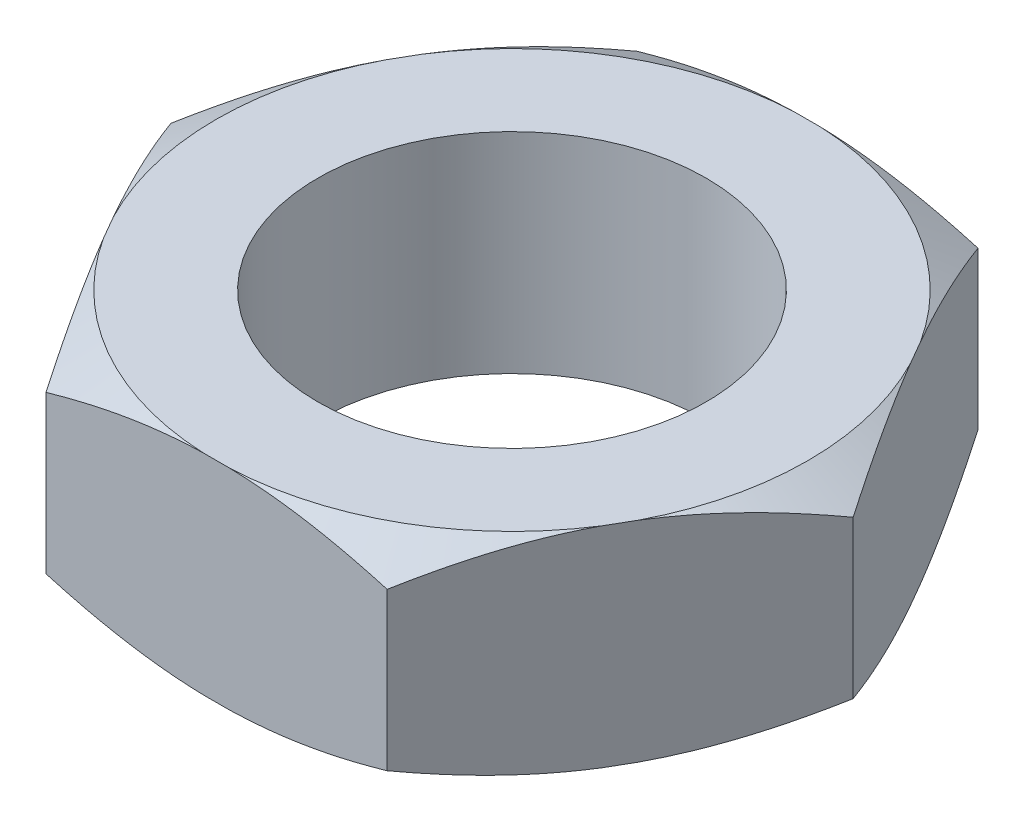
ISO-10303-21;
HEADER;
FILE_DESCRIPTION(('STEP AP214'),'2;1');
FILE_NAME('part.step','',(''),(''),'','','');
FILE_SCHEMA(('AUTOMOTIVE_DESIGN { 1 0 10303 214 1 1 1 1 }'));
ENDSEC;
DATA;
#1=APPLICATION_CONTEXT('core data for automotive mechanical design processes');
#2=APPLICATION_PROTOCOL_DEFINITION('international standard','automotive_design',2000,#1);
#3=PRODUCT_CONTEXT('',#1,'mechanical');
#4=PRODUCT('Part','Part','',(#3));
#5=PRODUCT_RELATED_PRODUCT_CATEGORY('part','',(#4));
#6=PRODUCT_DEFINITION_FORMATION('','',#4);
#7=PRODUCT_DEFINITION_CONTEXT('part definition',#1,'design');
#8=PRODUCT_DEFINITION('design','',#6,#7);
#9=PRODUCT_DEFINITION_SHAPE('','',#8);
#10=(LENGTH_UNIT() NAMED_UNIT(*) SI_UNIT(.MILLI.,.METRE.));
#11=(NAMED_UNIT(*) PLANE_ANGLE_UNIT() SI_UNIT($,.RADIAN.));
#12=(NAMED_UNIT(*) SI_UNIT($,.STERADIAN.) SOLID_ANGLE_UNIT());
#13=UNCERTAINTY_MEASURE_WITH_UNIT(LENGTH_MEASURE(1.E-05),#10,'distance_accuracy_value','');
#14=(GEOMETRIC_REPRESENTATION_CONTEXT(3) GLOBAL_UNCERTAINTY_ASSIGNED_CONTEXT((#13)) GLOBAL_UNIT_ASSIGNED_CONTEXT((#10,
#11,#12)) REPRESENTATION_CONTEXT('',''));
#15=CARTESIAN_POINT('',(0.,0.,0.));
#16=DIRECTION('',(0.,0.,1.));
#17=DIRECTION('',(1.,0.,0.));
#18=AXIS2_PLACEMENT_3D('',#15,#16,#17);
#19=CARTESIAN_POINT('',(2.19749999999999,2.7,3.80618164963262));
#20=DIRECTION('',(-0.866025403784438,0.,-0.500000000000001));
#21=DIRECTION('',(-0.500000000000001,0.,0.866025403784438));
#22=AXIS2_PLACEMENT_3D('',#19,#20,#21);
#23=PLANE('',#22);
#24=DIRECTION('',(0.,-1.,0.));
#25=VECTOR('',#24,1.);
#26=CARTESIAN_POINT('',(4.395,2.7,0.));
#27=LINE('',#26,#25);
#28=CARTESIAN_POINT('',(4.395,2.36225009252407,0.));
#29=VERTEX_POINT('',#28);
#30=CARTESIAN_POINT('',(4.395,0.337749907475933,0.));
#31=VERTEX_POINT('',#30);
#32=EDGE_CURVE('E231',#29,#31,#27,.T.);
#33=ORIENTED_EDGE('',*,*,#32,.F.);
#34=CARTESIAN_POINT('',(5.95735978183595,1.12200505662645,-2.70608652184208));
#35=CARTESIAN_POINT('',(5.88808187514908,1.18705963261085,-2.58609366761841));
#36=CARTESIAN_POINT('',(5.81864167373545,1.25143316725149,-2.46581971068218));
#37=CARTESIAN_POINT('',(5.6793682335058,1.37849926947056,-2.22459103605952));
#38=CARTESIAN_POINT('',(5.60953494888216,1.44119163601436,-2.10363623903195));
#39=CARTESIAN_POINT('',(5.46920838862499,1.56475015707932,-1.86058350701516));
#40=CARTESIAN_POINT('',(5.39871374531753,1.62561011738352,-1.7384832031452));
#41=CARTESIAN_POINT('',(5.25720607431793,1.74486440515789,-1.49338472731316));
#42=CARTESIAN_POINT('',(5.18619306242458,1.80325880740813,-1.37038658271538));
#43=CARTESIAN_POINT('',(5.04163300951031,1.9185835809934,-1.12000122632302));
#44=CARTESIAN_POINT('',(4.96806943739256,1.97543143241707,-0.992585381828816));
#45=CARTESIAN_POINT('',(4.8202166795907,2.08521263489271,-0.736496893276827));
#46=CARTESIAN_POINT('',(4.74592753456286,2.13814620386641,-0.607824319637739));
#47=CARTESIAN_POINT('',(4.59659008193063,2.23913342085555,-0.349164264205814));
#48=CARTESIAN_POINT('',(4.52154249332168,2.28719128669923,-0.219178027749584));
#49=CARTESIAN_POINT('',(4.3705626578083,2.37734319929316,0.0423267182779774));
#50=CARTESIAN_POINT('',(4.29463052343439,2.41943799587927,0.173845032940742));
#51=CARTESIAN_POINT('',(4.11357441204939,2.51058969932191,0.4874434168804));
#52=CARTESIAN_POINT('',(4.00803939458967,2.55646444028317,0.670235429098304));
#53=CARTESIAN_POINT('',(3.79542519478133,2.63086569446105,1.03849402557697));
#54=CARTESIAN_POINT('',(3.68834654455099,2.65939804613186,1.22395968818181));
#55=CARTESIAN_POINT('',(3.52774291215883,2.68684322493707,1.50213333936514));
#56=CARTESIAN_POINT('',(3.47453087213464,2.69343815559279,1.59429929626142));
#57=CARTESIAN_POINT('',(3.36800680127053,2.70149777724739,1.77880439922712));
#58=CARTESIAN_POINT('',(3.31469477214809,2.70296255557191,1.87114354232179));
#59=CARTESIAN_POINT('',(3.20809859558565,2.70070950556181,2.05577353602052));
#60=CARTESIAN_POINT('',(3.15481444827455,2.69699165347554,2.14806438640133));
#61=CARTESIAN_POINT('',(3.0483938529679,2.68448925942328,2.33239026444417));
#62=CARTESIAN_POINT('',(2.99525741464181,2.67570439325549,2.42442527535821));
#63=CARTESIAN_POINT('',(2.87120497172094,2.64950649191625,2.6392904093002));
#64=CARTESIAN_POINT('',(2.80038944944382,2.63017498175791,2.76194649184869));
#65=CARTESIAN_POINT('',(2.65939887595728,2.58374180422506,3.00614932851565));
#66=CARTESIAN_POINT('',(2.58922392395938,2.55663895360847,3.12769591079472));
#67=CARTESIAN_POINT('',(2.44954512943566,2.4956869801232,3.36962667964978));
#68=CARTESIAN_POINT('',(2.3800420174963,2.46183122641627,3.4900096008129));
#69=CARTESIAN_POINT('',(2.24180045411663,2.38843515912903,3.72945101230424));
#70=CARTESIAN_POINT('',(2.17306198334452,2.34889498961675,3.84850953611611));
#71=CARTESIAN_POINT('',(1.96626152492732,2.22219155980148,4.20669843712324));
#72=CARTESIAN_POINT('',(1.82931880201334,2.12773668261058,4.44389019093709));
#73=CARTESIAN_POINT('',(1.55796923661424,1.92590262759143,4.91388142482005));
#74=CARTESIAN_POINT('',(1.42356129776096,1.81852919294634,5.14668280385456));
#75=CARTESIAN_POINT('',(1.234610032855,1.66022362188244,5.47395599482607));
#76=CARTESIAN_POINT('',(1.17928706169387,1.61296859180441,5.56977819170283));
#77=CARTESIAN_POINT('',(1.06893267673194,1.5171286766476,5.7609175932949));
#78=CARTESIAN_POINT('',(1.01390125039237,1.46854384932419,5.85623481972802));
#79=CARTESIAN_POINT('',(0.850582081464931,1.32229324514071,6.13911191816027));
#80=CARTESIAN_POINT('',(0.742668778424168,1.2229469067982,6.32602324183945));
#81=CARTESIAN_POINT('',(0.635140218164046,1.12200505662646,6.51226817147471));
#82=B_SPLINE_CURVE_WITH_KNOTS('',3,(#34,#35,#36,#37,#38,#39,#40,#41,#42,#43,#44,#45,#46,#47,#48,
#49,#50,#51,#52,#53,#54,#55,#56,#57,#58,#59,#60,#61,#62,#63,#64,#65,#66,#67,#68,#69,#70,#71,#72,
#73,#74,#75,#76,#77,#78,#79,#80,#81),.UNSPECIFIED.,.F.,.F.,(4,2,2,2,2,2,2,2,2,2,2,2,2,2,2,2,2,2,
2,2,2,2,2,4),(0.,0.459208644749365,0.918471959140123,1.37914456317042,1.839803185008,
2.31294159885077,2.78605365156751,3.25875287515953,3.73139260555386,4.37881851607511,
5.02602634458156,5.34580477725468,5.66557776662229,5.9853522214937,6.30514713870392,
6.73372392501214,7.1623659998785,7.59143105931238,8.02048524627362,8.88906520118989,
9.75726042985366,10.1181972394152,10.4791183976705,11.1918381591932),.UNSPECIFIED.);
#83=CARTESIAN_POINT('',(3.38151612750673,2.7,1.75540555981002));
#84=VERTEX_POINT('',#83);
#85=EDGE_CURVE('E351',#29,#84,#82,.T.);
#86=ORIENTED_EDGE('',*,*,#85,.T.);
#87=DIRECTION('',(0.500000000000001,0.,-0.866025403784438));
#88=VECTOR('',#87,1.);
#89=CARTESIAN_POINT('',(2.19749999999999,2.7,3.80618164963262));
#90=LINE('',#89,#88);
#91=CARTESIAN_POINT('',(3.21098387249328,2.7,2.0507760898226));
#92=VERTEX_POINT('',#91);
#93=EDGE_CURVE('E200',#92,#84,#90,.T.);
#94=ORIENTED_EDGE('',*,*,#93,.F.);
#95=CARTESIAN_POINT('',(2.19749999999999,2.36225009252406,3.80618164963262));
#96=VERTEX_POINT('',#95);
#97=EDGE_CURVE('E371',#92,#96,#82,.T.);
#98=ORIENTED_EDGE('',*,*,#97,.T.);
#99=DIRECTION('',(0.,-1.,0.));
#100=VECTOR('',#99,1.);
#101=CARTESIAN_POINT('',(2.19749999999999,2.7,3.80618164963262));
#102=LINE('',#101,#100);
#103=CARTESIAN_POINT('',(2.19749999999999,0.337749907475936,3.80618164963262));
#104=VERTEX_POINT('',#103);
#105=EDGE_CURVE('E218',#96,#104,#102,.T.);
#106=ORIENTED_EDGE('',*,*,#105,.T.);
#107=CARTESIAN_POINT('',(5.96059679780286,1.5810358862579,-2.71169319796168));
#108=CARTESIAN_POINT('',(5.89129661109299,1.51593359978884,-2.59166175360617));
#109=CARTESIAN_POINT('',(5.82183437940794,1.45151105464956,-2.47134963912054));
#110=CARTESIAN_POINT('',(5.6825174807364,1.32434364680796,-2.23004569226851));
#111=CARTESIAN_POINT('',(5.61266276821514,1.26159898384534,-2.10905378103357));
#112=CARTESIAN_POINT('',(5.47229476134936,1.13793241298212,-1.86592926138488));
#113=CARTESIAN_POINT('',(5.40178010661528,1.07701666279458,-1.74379429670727));
#114=CARTESIAN_POINT('',(5.26023311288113,0.95764573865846,-1.49862771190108));
#115=CARTESIAN_POINT('',(5.1892007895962,0.899190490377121,-1.37559611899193));
#116=CARTESIAN_POINT('',(5.04459251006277,0.78372826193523,-1.12512723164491));
#117=CARTESIAN_POINT('',(4.97099995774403,0.726804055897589,-0.997661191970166));
#118=CARTESIAN_POINT('',(4.82308972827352,0.616863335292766,-0.741473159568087));
#119=CARTESIAN_POINT('',(4.74877209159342,0.563846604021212,-0.612751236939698));
#120=CARTESIAN_POINT('',(4.59937764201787,0.462685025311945,-0.353992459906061));
#121=CARTESIAN_POINT('',(4.52430154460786,0.414535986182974,-0.223956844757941));
#122=CARTESIAN_POINT('',(4.3732644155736,0.324193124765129,0.0376471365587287));
#123=CARTESIAN_POINT('',(4.29730349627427,0.281998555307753,0.169215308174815));
#124=CARTESIAN_POINT('',(4.11622361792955,0.190623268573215,0.482854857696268));
#125=CARTESIAN_POINT('',(4.01069395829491,0.144615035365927,0.665637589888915));
#126=CARTESIAN_POINT('',(3.79808664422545,0.0699195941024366,1.03388425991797));
#127=CARTESIAN_POINT('',(3.69100952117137,0.0412265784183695,1.21934727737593));
#128=CARTESIAN_POINT('',(3.53040466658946,0.0135305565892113,1.49752304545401));
#129=CARTESIAN_POINT('',(3.477192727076,0.00685089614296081,1.58968882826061));
#130=CARTESIAN_POINT('',(3.3706668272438,-0.0013797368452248,1.77419709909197));
#131=CARTESIAN_POINT('',(3.31735286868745,-0.00293079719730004,1.8665395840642));
#132=CARTESIAN_POINT('',(3.21075088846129,-0.000849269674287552,2.05117963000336));
#133=CARTESIAN_POINT('',(3.15746286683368,0.00278332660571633,2.14347719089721));
#134=CARTESIAN_POINT('',(3.05103263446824,0.0151187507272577,2.32781976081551));
#135=CARTESIAN_POINT('',(2.99789043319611,0.0238219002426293,2.41986475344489));
#136=CARTESIAN_POINT('',(2.87394986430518,0.0498084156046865,2.63453611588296));
#137=CARTESIAN_POINT('',(2.80325056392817,0.0689969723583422,2.75699089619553));
#138=CARTESIAN_POINT('',(2.66248827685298,0.115131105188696,3.00079832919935));
#139=CARTESIAN_POINT('',(2.59242538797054,0.14207785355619,3.12215081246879));
#140=CARTESIAN_POINT('',(2.45296757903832,0.202710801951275,3.36369882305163));
#141=CARTESIAN_POINT('',(2.38357338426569,0.236403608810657,3.48389309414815));
#142=CARTESIAN_POINT('',(2.24554711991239,0.309471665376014,3.722961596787));
#143=CARTESIAN_POINT('',(2.17691503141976,0.348846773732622,3.8418358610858));
#144=CARTESIAN_POINT('',(1.9704261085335,0.475057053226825,4.19948516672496));
#145=CARTESIAN_POINT('',(1.83368619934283,0.569186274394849,4.43632563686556));
#146=CARTESIAN_POINT('',(1.56274035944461,0.770382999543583,4.90561759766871));
#147=CARTESIAN_POINT('',(1.42853334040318,0.877444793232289,5.13807097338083));
#148=CARTESIAN_POINT('',(1.23905722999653,1.035995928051,5.46625322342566));
#149=CARTESIAN_POINT('',(1.18301311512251,1.08382537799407,5.5633244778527));
#150=CARTESIAN_POINT('',(1.07122464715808,1.1808522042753,5.75694778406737));
#151=CARTESIAN_POINT('',(1.0154802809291,1.23004952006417,5.8534998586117));
#152=CARTESIAN_POINT('',(0.85007107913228,1.37815015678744,6.1399970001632));
#153=CARTESIAN_POINT('',(0.740790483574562,1.47877841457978,6.32927654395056));
#154=CARTESIAN_POINT('',(0.631903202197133,1.5810358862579,6.51787484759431));
#155=B_SPLINE_CURVE_WITH_KNOTS('',3,(#107,#108,#109,#110,#111,#112,#113,#114,#115,#116,#117,
#118,#119,#120,#121,#122,#123,#124,#125,#126,#127,#128,#129,#130,#131,#132,#133,#134,#135,#136,
#137,#138,#139,#140,#141,#142,#143,#144,#145,#146,#147,#148,#149,#150,#151,#152,#153,#154),
.UNSPECIFIED.,.F.,.F.,(4,2,2,2,2,2,2,2,2,2,2,2,2,2,2,2,2,2,2,2,2,2,2,4),(0.,0.459390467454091,
0.918835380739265,1.37968464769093,1.84051998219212,2.31390334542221,2.78726043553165,
3.26020637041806,3.73309290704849,4.38057473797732,5.02783927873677,5.3476330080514,
5.6674212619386,5.98721003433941,6.30701909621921,6.73484783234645,7.16274124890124,
7.59105579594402,8.01935969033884,8.8864694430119,9.75319771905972,10.1187901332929,
10.4843663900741,11.2061438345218),.UNSPECIFIED.);
#156=CARTESIAN_POINT('',(3.21098387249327,0.,2.05077608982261));
#157=VERTEX_POINT('',#156);
#158=EDGE_CURVE('E271',#157,#104,#155,.T.);
#159=ORIENTED_EDGE('',*,*,#158,.F.);
#160=DIRECTION('',(0.500000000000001,0.,-0.866025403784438));
#161=VECTOR('',#160,1.);
#162=CARTESIAN_POINT('',(2.19749999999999,0.,3.80618164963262));
#163=LINE('',#162,#161);
#164=CARTESIAN_POINT('',(3.38151612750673,0.,1.75540555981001));
#165=VERTEX_POINT('',#164);
#166=EDGE_CURVE('E191',#157,#165,#163,.T.);
#167=ORIENTED_EDGE('',*,*,#166,.T.);
#168=EDGE_CURVE('E276',#31,#165,#155,.T.);
#169=ORIENTED_EDGE('',*,*,#168,.F.);
#170=EDGE_LOOP('',(#33,#86,#94,#98,#106,#159,#167,#169));
#171=FACE_BOUND('',#170,.T.);
#172=ADVANCED_FACE('F32',(#171),#23,.F.);
#173=CARTESIAN_POINT('',(4.395,2.7,0.));
#174=DIRECTION('',(-0.866025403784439,0.,0.5));
#175=DIRECTION('',(0.5,0.,0.866025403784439));
#176=AXIS2_PLACEMENT_3D('',#173,#174,#175);
#177=PLANE('',#176);
#178=DIRECTION('',(0.,-1.,0.));
#179=VECTOR('',#178,1.);
#180=CARTESIAN_POINT('',(2.19749999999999,2.7,-3.80618164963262));
#181=LINE('',#180,#179);
#182=CARTESIAN_POINT('',(2.19749999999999,2.36225009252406,-3.80618164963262));
#183=VERTEX_POINT('',#182);
#184=CARTESIAN_POINT('',(2.19749999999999,0.337749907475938,-3.80618164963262));
#185=VERTEX_POINT('',#184);
#186=EDGE_CURVE('E177',#183,#185,#181,.T.);
#187=ORIENTED_EDGE('',*,*,#186,.F.);
#188=CARTESIAN_POINT('',(0.635140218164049,1.12200505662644,-6.51226817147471));
#189=CARTESIAN_POINT('',(0.704418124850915,1.18705963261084,-6.39227531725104));
#190=CARTESIAN_POINT('',(0.77385832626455,1.25143316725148,-6.27200136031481));
#191=CARTESIAN_POINT('',(0.913131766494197,1.37849926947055,-6.03077268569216));
#192=CARTESIAN_POINT('',(0.982965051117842,1.44119163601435,-5.90981788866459));
#193=CARTESIAN_POINT('',(1.12329161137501,1.56475015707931,-5.66676515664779));
#194=CARTESIAN_POINT('',(1.19378625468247,1.62561011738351,-5.54466485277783));
#195=CARTESIAN_POINT('',(1.33529392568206,1.74486440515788,-5.29956637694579));
#196=CARTESIAN_POINT('',(1.40630693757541,1.80325880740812,-5.17656823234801));
#197=CARTESIAN_POINT('',(1.55086699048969,1.9185835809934,-4.92618287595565));
#198=CARTESIAN_POINT('',(1.62443056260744,1.97543143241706,-4.79876703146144));
#199=CARTESIAN_POINT('',(1.77228332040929,2.0852126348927,-4.54267854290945));
#200=CARTESIAN_POINT('',(1.84657246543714,2.13814620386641,-4.41400596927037));
#201=CARTESIAN_POINT('',(1.99590991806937,2.23913342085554,-4.15534591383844));
#202=CARTESIAN_POINT('',(2.07095750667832,2.28719128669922,-4.02535967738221));
#203=CARTESIAN_POINT('',(2.2219373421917,2.37734319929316,-3.76385493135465));
#204=CARTESIAN_POINT('',(2.29786947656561,2.41943799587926,-3.63233661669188));
#205=CARTESIAN_POINT('',(2.4789255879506,2.51058969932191,-3.31873823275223));
#206=CARTESIAN_POINT('',(2.58446060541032,2.55646444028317,-3.13594622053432));
#207=CARTESIAN_POINT('',(2.79707480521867,2.63086569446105,-2.76768762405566));
#208=CARTESIAN_POINT('',(2.90415345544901,2.65939804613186,-2.58222196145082));
#209=CARTESIAN_POINT('',(3.06475708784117,2.68684322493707,-2.30404831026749));
#210=CARTESIAN_POINT('',(3.11796912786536,2.69343815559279,-2.2118823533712));
#211=CARTESIAN_POINT('',(3.22449319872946,2.70149777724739,-2.0273772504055));
#212=CARTESIAN_POINT('',(3.27780522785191,2.70296255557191,-1.93503810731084));
#213=CARTESIAN_POINT('',(3.38440140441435,2.70070950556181,-1.7504081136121));
#214=CARTESIAN_POINT('',(3.43768555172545,2.69699165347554,-1.65811726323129));
#215=CARTESIAN_POINT('',(3.54410614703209,2.68448925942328,-1.47379138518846));
#216=CARTESIAN_POINT('',(3.59724258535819,2.6757043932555,-1.38175637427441));
#217=CARTESIAN_POINT('',(3.72129502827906,2.64950649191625,-1.16689124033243));
#218=CARTESIAN_POINT('',(3.79211055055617,2.63017498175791,-1.04423515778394));
#219=CARTESIAN_POINT('',(3.93310112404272,2.58374180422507,-0.800032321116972));
#220=CARTESIAN_POINT('',(4.00327607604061,2.55663895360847,-0.678485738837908));
#221=CARTESIAN_POINT('',(4.14295487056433,2.49568698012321,-0.436554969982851));
#222=CARTESIAN_POINT('',(4.2124579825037,2.46183122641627,-0.316172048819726));
#223=CARTESIAN_POINT('',(4.35069954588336,2.38843515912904,-0.0767306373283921));
#224=CARTESIAN_POINT('',(4.41943801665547,2.34889498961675,0.042327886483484));
#225=CARTESIAN_POINT('',(4.62623847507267,2.22219155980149,0.400516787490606));
#226=CARTESIAN_POINT('',(4.76318119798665,2.12773668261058,0.637708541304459));
#227=CARTESIAN_POINT('',(5.03453076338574,1.92590262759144,1.10769977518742));
#228=CARTESIAN_POINT('',(5.16893870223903,1.81852919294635,1.34050115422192));
#229=CARTESIAN_POINT('',(5.35788996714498,1.66022362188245,1.66777434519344));
#230=CARTESIAN_POINT('',(5.41321293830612,1.61296859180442,1.7635965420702));
#231=CARTESIAN_POINT('',(5.52356732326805,1.51712867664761,1.95473594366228));
#232=CARTESIAN_POINT('',(5.57859874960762,1.4685438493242,2.0500531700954));
#233=CARTESIAN_POINT('',(5.74191791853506,1.32229324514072,2.33293026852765));
#234=CARTESIAN_POINT('',(5.84983122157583,1.22294690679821,2.51984159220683));
#235=CARTESIAN_POINT('',(5.95735978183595,1.12200505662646,2.7060865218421));
#236=B_SPLINE_CURVE_WITH_KNOTS('',3,(#188,#189,#190,#191,#192,#193,#194,#195,#196,#197,#198,
#199,#200,#201,#202,#203,#204,#205,#206,#207,#208,#209,#210,#211,#212,#213,#214,#215,#216,#217,
#218,#219,#220,#221,#222,#223,#224,#225,#226,#227,#228,#229,#230,#231,#232,#233,#234,#235),
.UNSPECIFIED.,.F.,.F.,(4,2,2,2,2,2,2,2,2,2,2,2,2,2,2,2,2,2,2,2,2,2,2,4),(0.,0.459208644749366,
0.918471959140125,1.37914456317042,1.83980318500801,2.31294159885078,2.78605365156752,
3.25875287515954,3.73139260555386,4.37881851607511,5.02602634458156,5.34580477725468,
5.6655777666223,5.98535222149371,6.30514713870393,6.73372392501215,7.1623659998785,
7.59143105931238,8.02048524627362,8.88906520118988,9.75726042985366,10.1181972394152,
10.4791183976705,11.1918381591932),.UNSPECIFIED.);
#237=CARTESIAN_POINT('',(3.21098387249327,2.7,-2.05077608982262));
#238=VERTEX_POINT('',#237);
#239=EDGE_CURVE('E343',#183,#238,#236,.T.);
#240=ORIENTED_EDGE('',*,*,#239,.T.);
#241=DIRECTION('',(-0.5,0.,-0.866025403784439));
#242=VECTOR('',#241,1.);
#243=CARTESIAN_POINT('',(4.395,2.7,0.));
#244=LINE('',#243,#242);
#245=CARTESIAN_POINT('',(3.38151612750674,2.7,-1.75540555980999));
#246=VERTEX_POINT('',#245);
#247=EDGE_CURVE('E203',#246,#238,#244,.T.);
#248=ORIENTED_EDGE('',*,*,#247,.F.);
#249=EDGE_CURVE('E349',#246,#29,#236,.T.);
#250=ORIENTED_EDGE('',*,*,#249,.T.);
#251=ORIENTED_EDGE('',*,*,#32,.T.);
#252=CARTESIAN_POINT('',(0.631903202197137,1.58103588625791,-6.51787484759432));
#253=CARTESIAN_POINT('',(0.701203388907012,1.51593359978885,-6.3978434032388));
#254=CARTESIAN_POINT('',(0.770665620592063,1.45151105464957,-6.27753128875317));
#255=CARTESIAN_POINT('',(0.909982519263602,1.32434364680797,-6.03622734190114));
#256=CARTESIAN_POINT('',(0.979837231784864,1.26159898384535,-5.9152354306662));
#257=CARTESIAN_POINT('',(1.12020523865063,1.13793241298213,-5.67211091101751));
#258=CARTESIAN_POINT('',(1.19071989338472,1.07701666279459,-5.5499759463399));
#259=CARTESIAN_POINT('',(1.33226688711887,0.957645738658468,-5.30480936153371));
#260=CARTESIAN_POINT('',(1.4032992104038,0.899190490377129,-5.18177776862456));
#261=CARTESIAN_POINT('',(1.54790748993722,0.783728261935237,-4.93130888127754));
#262=CARTESIAN_POINT('',(1.62150004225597,0.726804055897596,-4.8038428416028));
#263=CARTESIAN_POINT('',(1.76941027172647,0.616863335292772,-4.54765480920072));
#264=CARTESIAN_POINT('',(1.84372790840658,0.563846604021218,-4.41893288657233));
#265=CARTESIAN_POINT('',(1.99312235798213,0.46268502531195,-4.16017410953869));
#266=CARTESIAN_POINT('',(2.06819845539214,0.41453598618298,-4.03013849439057));
#267=CARTESIAN_POINT('',(2.21923558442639,0.324193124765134,-3.7685345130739));
#268=CARTESIAN_POINT('',(2.29519650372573,0.281998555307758,-3.63696634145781));
#269=CARTESIAN_POINT('',(2.47627638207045,0.190623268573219,-3.32332679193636));
#270=CARTESIAN_POINT('',(2.58180604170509,0.144615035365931,-3.14054405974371));
#271=CARTESIAN_POINT('',(2.79441335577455,0.069919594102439,-2.77229738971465));
#272=CARTESIAN_POINT('',(2.90149047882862,0.0412265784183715,-2.5868343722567));
#273=CARTESIAN_POINT('',(3.06209533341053,0.013530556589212,-2.30865860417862));
#274=CARTESIAN_POINT('',(3.115307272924,0.00685089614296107,-2.21649282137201));
#275=CARTESIAN_POINT('',(3.22183317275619,-0.00137973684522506,-2.03198455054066));
#276=CARTESIAN_POINT('',(3.27514713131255,-0.00293079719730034,-1.93964206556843));
#277=CARTESIAN_POINT('',(3.38174911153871,-0.000849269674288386,-1.75500201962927));
#278=CARTESIAN_POINT('',(3.43503713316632,0.00278332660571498,-1.66270445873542));
#279=CARTESIAN_POINT('',(3.54146736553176,0.0151187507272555,-1.47836188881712));
#280=CARTESIAN_POINT('',(3.59460956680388,0.0238219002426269,-1.38631689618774));
#281=CARTESIAN_POINT('',(3.71855013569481,0.0498084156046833,-1.17164553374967));
#282=CARTESIAN_POINT('',(3.78924943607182,0.0689969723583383,-1.0491907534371));
#283=CARTESIAN_POINT('',(3.93001172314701,0.115131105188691,-0.805383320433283));
#284=CARTESIAN_POINT('',(4.00007461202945,0.142077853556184,-0.68403083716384));
#285=CARTESIAN_POINT('',(4.13953242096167,0.202710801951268,-0.442482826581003));
#286=CARTESIAN_POINT('',(4.2089266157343,0.236403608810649,-0.322288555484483));
#287=CARTESIAN_POINT('',(4.3469528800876,0.309471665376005,-0.0832200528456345));
#288=CARTESIAN_POINT('',(4.41558496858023,0.348846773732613,0.0356542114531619));
#289=CARTESIAN_POINT('',(4.62207389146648,0.475057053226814,0.393303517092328));
#290=CARTESIAN_POINT('',(4.75881380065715,0.569186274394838,0.630143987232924));
#291=CARTESIAN_POINT('',(5.02975964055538,0.770382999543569,1.09943594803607));
#292=CARTESIAN_POINT('',(5.1639666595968,0.877444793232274,1.33188932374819));
#293=CARTESIAN_POINT('',(5.35344277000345,1.03599592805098,1.66007157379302));
#294=CARTESIAN_POINT('',(5.40948688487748,1.08382537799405,1.75714282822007));
#295=CARTESIAN_POINT('',(5.5212753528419,1.18085220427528,1.95076613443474));
#296=CARTESIAN_POINT('',(5.57701971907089,1.23004952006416,2.04731820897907));
#297=CARTESIAN_POINT('',(5.74242892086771,1.37815015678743,2.33381535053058));
#298=CARTESIAN_POINT('',(5.85170951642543,1.47877841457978,2.52309489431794));
#299=CARTESIAN_POINT('',(5.96059679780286,1.5810358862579,2.7116931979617));
#300=B_SPLINE_CURVE_WITH_KNOTS('',3,(#252,#253,#254,#255,#256,#257,#258,#259,#260,#261,#262,
#263,#264,#265,#266,#267,#268,#269,#270,#271,#272,#273,#274,#275,#276,#277,#278,#279,#280,#281,
#282,#283,#284,#285,#286,#287,#288,#289,#290,#291,#292,#293,#294,#295,#296,#297,#298,#299),
.UNSPECIFIED.,.F.,.F.,(4,2,2,2,2,2,2,2,2,2,2,2,2,2,2,2,2,2,2,2,2,2,2,4),(0.,0.459390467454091,
0.918835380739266,1.37968464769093,1.84051998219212,2.31390334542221,2.78726043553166,
3.26020637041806,3.73309290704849,4.38057473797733,5.02783927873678,5.3476330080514,
5.6674212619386,5.98721003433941,6.30701909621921,6.73484783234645,7.16274124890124,
7.59105579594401,8.01935969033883,8.88646944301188,9.7531977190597,10.1187901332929,
10.4843663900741,11.2061438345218),.UNSPECIFIED.);
#301=CARTESIAN_POINT('',(3.38151612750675,0.,-1.75540555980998));
#302=VERTEX_POINT('',#301);
#303=EDGE_CURVE('E359',#302,#31,#300,.T.);
#304=ORIENTED_EDGE('',*,*,#303,.F.);
#305=DIRECTION('',(-0.5,0.,-0.866025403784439));
#306=VECTOR('',#305,1.);
#307=CARTESIAN_POINT('',(4.395,0.,0.));
#308=LINE('',#307,#306);
#309=CARTESIAN_POINT('',(3.21098387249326,0.,-2.05077608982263));
#310=VERTEX_POINT('',#309);
#311=EDGE_CURVE('E186',#302,#310,#308,.T.);
#312=ORIENTED_EDGE('',*,*,#311,.T.);
#313=EDGE_CURVE('E161',#185,#310,#300,.T.);
#314=ORIENTED_EDGE('',*,*,#313,.F.);
#315=EDGE_LOOP('',(#187,#240,#248,#250,#251,#304,#312,#314));
#316=FACE_BOUND('',#315,.T.);
#317=ADVANCED_FACE('F324',(#316),#177,.F.);
#318=CARTESIAN_POINT('',(2.19749999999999,2.7,-3.80618164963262));
#319=DIRECTION('',(0.,0.,1.));
#320=DIRECTION('',(1.,0.,0.));
#321=AXIS2_PLACEMENT_3D('',#318,#319,#320);
#322=PLANE('',#321);
#323=DIRECTION('',(0.,-1.,0.));
#324=VECTOR('',#323,1.);
#325=CARTESIAN_POINT('',(-2.1975,2.7,-3.80618164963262));
#326=LINE('',#325,#324);
#327=CARTESIAN_POINT('',(-2.1975,2.36225009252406,-3.80618164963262));
#328=VERTEX_POINT('',#327);
#329=CARTESIAN_POINT('',(-2.1975,0.33774990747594,-3.80618164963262));
#330=VERTEX_POINT('',#329);
#331=EDGE_CURVE('E227',#328,#330,#326,.T.);
#332=ORIENTED_EDGE('',*,*,#331,.F.);
#333=CARTESIAN_POINT('',(-4.90358652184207,1.31584350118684,-3.80618164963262));
#334=CARTESIAN_POINT('',(-4.76576884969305,1.37868312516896,-3.80618164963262));
#335=CARTESIAN_POINT('',(-4.62758151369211,1.44072657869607,-3.80618164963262));
#336=CARTESIAN_POINT('',(-4.35030860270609,1.56283604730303,-3.80618164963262));
#337=CARTESIAN_POINT('',(-4.21122287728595,1.62290172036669,-3.80618164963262));
#338=CARTESIAN_POINT('',(-3.9314817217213,1.74088477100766,-3.80618164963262));
#339=CARTESIAN_POINT('',(-3.79082223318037,1.79879256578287,-3.80618164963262));
#340=CARTESIAN_POINT('',(-3.5083342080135,1.91167131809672,-3.80618164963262));
#341=CARTESIAN_POINT('',(-3.36650572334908,1.96664240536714,-3.80618164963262));
#342=CARTESIAN_POINT('',(-3.0820005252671,2.0728098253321,-3.80618164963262));
#343=CARTESIAN_POINT('',(-2.93932857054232,2.12401879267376,-3.80618164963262));
#344=CARTESIAN_POINT('',(-2.65248929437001,2.22205788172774,-3.80618164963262));
#345=CARTESIAN_POINT('',(-2.5083218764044,2.26888771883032,-3.80618164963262));
#346=CARTESIAN_POINT('',(-2.07371074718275,2.40126304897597,-3.80618164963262));
#347=CARTESIAN_POINT('',(-1.78071145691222,2.47886722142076,-3.80618164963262));
#348=CARTESIAN_POINT('',(-1.27323586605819,2.5852783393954,-3.80618164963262));
#349=CARTESIAN_POINT('',(-1.06039505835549,2.62169967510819,-3.80618164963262));
#350=CARTESIAN_POINT('',(-0.739360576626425,2.66194469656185,-3.80618164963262));
#351=CARTESIAN_POINT('',(-0.632053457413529,2.67296187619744,-3.80618164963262));
#352=CARTESIAN_POINT('',(-0.417043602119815,2.68990649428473,-3.80618164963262));
#353=CARTESIAN_POINT('',(-0.309340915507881,2.6958345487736,-3.80618164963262));
#354=CARTESIAN_POINT('',(-0.0938468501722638,2.70241422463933,-3.80618164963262));
#355=CARTESIAN_POINT('',(0.013944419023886,2.70306941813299,-3.80618164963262));
#356=CARTESIAN_POINT('',(0.229427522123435,2.69909409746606,-3.80618164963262));
#357=CARTESIAN_POINT('',(0.337119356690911,2.69446361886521,-3.80618164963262));
#358=CARTESIAN_POINT('',(0.552153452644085,2.68005819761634,-3.80618164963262));
#359=CARTESIAN_POINT('',(0.65949572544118,2.67028342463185,-3.80618164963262));
#360=CARTESIAN_POINT('',(0.873634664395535,2.64587666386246,-3.80618164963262));
#361=CARTESIAN_POINT('',(0.98043122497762,2.63124376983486,-3.80618164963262));
#362=CARTESIAN_POINT('',(1.4172673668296,2.56197900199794,-3.80618164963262));
#363=CARTESIAN_POINT('',(1.74433070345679,2.48795789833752,-3.80618164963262));
#364=CARTESIAN_POINT('',(2.22868912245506,2.35452954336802,-3.80618164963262));
#365=CARTESIAN_POINT('',(2.38934347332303,2.30622951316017,-3.80618164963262));
#366=CARTESIAN_POINT('',(2.70873566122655,2.20361478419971,-3.80618164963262));
#367=CARTESIAN_POINT('',(2.86747364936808,2.14930056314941,-3.80618164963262));
#368=CARTESIAN_POINT('',(3.18535513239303,2.03510453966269,-3.80618164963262));
#369=CARTESIAN_POINT('',(3.34447465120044,1.97515692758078,-3.80618164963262));
#370=CARTESIAN_POINT('',(3.66118511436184,1.85133146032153,-3.80618164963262));
#371=CARTESIAN_POINT('',(3.81877595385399,1.78745333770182,-3.80618164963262));
#372=CARTESIAN_POINT('',(4.13154523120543,1.65701847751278,-3.80618164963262));
#373=CARTESIAN_POINT('',(4.28673283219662,1.59048359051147,-3.80618164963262));
#374=CARTESIAN_POINT('',(4.59596124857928,1.45490618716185,-3.80618164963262));
#375=CARTESIAN_POINT('',(4.75000235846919,1.38586434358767,-3.80618164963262));
#376=CARTESIAN_POINT('',(4.90358652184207,1.31584350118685,-3.80618164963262));
#377=B_SPLINE_CURVE_WITH_KNOTS('',3,(#333,#334,#335,#336,#337,#338,#339,#340,#341,#342,#343,
#344,#345,#346,#347,#348,#349,#350,#351,#352,#353,#354,#355,#356,#357,#358,#359,#360,#361,#362,
#363,#364,#365,#366,#367,#368,#369,#370,#371,#372,#373,#374,#375,#376),.UNSPECIFIED.,.F.,.F.,(4,
2,2,2,2,2,2,2,2,2,2,2,2,2,2,2,2,2,2,2,2,4),(0.,0.454410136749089,0.908898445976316,
1.36520964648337,1.82150067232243,2.276181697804,2.73089225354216,3.6388789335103,
4.28589385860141,4.60940180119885,4.93287057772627,5.25612020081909,5.57936764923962,
5.90260443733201,6.22590155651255,7.2292883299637,7.73252382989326,8.23571938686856,
8.7457752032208,9.25586576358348,9.76238994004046,10.2687791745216),.UNSPECIFIED.);
#378=CARTESIAN_POINT('',(-0.170532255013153,2.7,-3.80618164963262));
#379=VERTEX_POINT('',#378);
#380=EDGE_CURVE('E329',#328,#379,#377,.T.);
#381=ORIENTED_EDGE('',*,*,#380,.T.);
#382=DIRECTION('',(-1.,0.,0.));
#383=VECTOR('',#382,1.);
#384=CARTESIAN_POINT('',(2.19749999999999,2.7,-3.80618164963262));
#385=LINE('',#384,#383);
#386=CARTESIAN_POINT('',(0.170532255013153,2.7,-3.80618164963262));
#387=VERTEX_POINT('',#386);
#388=EDGE_CURVE('E206',#387,#379,#385,.T.);
#389=ORIENTED_EDGE('',*,*,#388,.F.);
#390=EDGE_CURVE('E336',#387,#183,#377,.T.);
#391=ORIENTED_EDGE('',*,*,#390,.T.);
#392=ORIENTED_EDGE('',*,*,#186,.T.);
#393=CARTESIAN_POINT('',(-4.90919319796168,1.38671414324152,-3.80618164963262));
#394=CARTESIAN_POINT('',(-4.77134797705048,1.32383492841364,-3.80618164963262));
#395=CARTESIAN_POINT('',(-4.63313364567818,1.26175038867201,-3.80618164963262));
#396=CARTESIAN_POINT('',(-4.3558080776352,1.13955494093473,-3.80618164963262));
#397=CARTESIAN_POINT('',(-4.21669669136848,1.07944437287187,-3.80618164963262));
#398=CARTESIAN_POINT('',(-3.93690751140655,0.96136749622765,-3.80618164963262));
#399=CARTESIAN_POINT('',(-3.79622567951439,0.903410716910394,-3.80618164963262));
#400=CARTESIAN_POINT('',(-3.5136944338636,0.790428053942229,-3.80618164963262));
#401=CARTESIAN_POINT('',(-3.37184507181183,0.735402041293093,-3.80618164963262));
#402=CARTESIAN_POINT('',(-3.08728762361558,0.629113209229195,-3.80618164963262));
#403=CARTESIAN_POINT('',(-2.94458417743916,0.577838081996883,-3.80618164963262));
#404=CARTESIAN_POINT('',(-2.65768276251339,0.479658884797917,-3.80618164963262));
#405=CARTESIAN_POINT('',(-2.51348469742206,0.432755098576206,-3.80618164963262));
#406=CARTESIAN_POINT('',(-2.07878050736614,0.300143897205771,-3.80618164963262));
#407=CARTESIAN_POINT('',(-1.78571943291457,0.222364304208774,-3.80618164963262));
#408=CARTESIAN_POINT('',(-1.27824002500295,0.115645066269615,-3.80618164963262));
#409=CARTESIAN_POINT('',(-1.06546169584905,0.0790917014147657,-3.80618164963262));
#410=CARTESIAN_POINT('',(-0.744513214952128,0.0386256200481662,-3.80618164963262));
#411=CARTESIAN_POINT('',(-0.637233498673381,0.0275309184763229,-3.80618164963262));
#412=CARTESIAN_POINT('',(-0.422275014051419,0.0104253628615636,-3.80618164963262));
#413=CARTESIAN_POINT('',(-0.314596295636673,0.00441389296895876,-3.80618164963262));
#414=CARTESIAN_POINT('',(-0.099148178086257,-0.00233609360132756,-3.80618164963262));
#415=CARTESIAN_POINT('',(0.0086211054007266,-0.003078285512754,-3.80618164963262));
#416=CARTESIAN_POINT('',(0.224064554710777,0.000721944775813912,-3.80618164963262));
#417=CARTESIAN_POINT('',(0.331738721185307,0.00526433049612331,-3.80618164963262));
#418=CARTESIAN_POINT('',(0.546740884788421,0.0194951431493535,-3.80618164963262));
#419=CARTESIAN_POINT('',(0.654068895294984,0.0291833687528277,-3.80618164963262));
#420=CARTESIAN_POINT('',(0.868182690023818,0.0534207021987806,-3.80618164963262));
#421=CARTESIAN_POINT('',(0.974968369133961,0.0679707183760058,-3.80618164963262));
#422=CARTESIAN_POINT('',(1.41275273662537,0.137063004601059,-3.80618164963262));
#423=CARTESIAN_POINT('',(1.74076640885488,0.21114893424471,-3.80618164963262));
#424=CARTESIAN_POINT('',(2.22651506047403,0.344827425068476,-3.80618164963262));
#425=CARTESIAN_POINT('',(2.38763049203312,0.393237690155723,-3.80618164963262));
#426=CARTESIAN_POINT('',(2.70793367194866,0.496110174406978,-3.80618164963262));
#427=CARTESIAN_POINT('',(2.86712157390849,0.550571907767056,-3.80618164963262));
#428=CARTESIAN_POINT('',(3.18593076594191,0.665103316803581,-3.80618164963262));
#429=CARTESIAN_POINT('',(3.34552758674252,0.725240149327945,-3.80618164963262));
#430=CARTESIAN_POINT('',(3.66318423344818,0.849464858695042,-3.80618164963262));
#431=CARTESIAN_POINT('',(3.82124395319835,0.913553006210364,-3.80618164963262));
#432=CARTESIAN_POINT('',(4.13492986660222,1.04441624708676,-3.80618164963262));
#433=CARTESIAN_POINT('',(4.29056536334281,1.11116916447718,-3.80618164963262));
#434=CARTESIAN_POINT('',(4.60068432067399,1.2471925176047,-3.80618164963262));
#435=CARTESIAN_POINT('',(4.75516807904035,1.31646227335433,-3.80618164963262));
#436=CARTESIAN_POINT('',(4.90919319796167,1.38671414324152,-3.80618164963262));
#437=B_SPLINE_CURVE_WITH_KNOTS('',3,(#393,#394,#395,#396,#397,#398,#399,#400,#401,#402,#403,
#404,#405,#406,#407,#408,#409,#410,#411,#412,#413,#414,#415,#416,#417,#418,#419,#420,#421,#422,
#423,#424,#425,#426,#427,#428,#429,#430,#431,#432,#433,#434,#435,#436),.UNSPECIFIED.,.F.,.F.,(4,
2,2,2,2,2,2,2,2,2,2,2,2,2,2,2,2,2,2,2,2,4),(0.,0.454534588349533,0.909147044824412,
1.36557629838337,1.82198544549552,2.27682271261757,2.73168948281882,3.63999403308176,
4.28689381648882,4.61034405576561,4.93375510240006,5.25694055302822,5.58012377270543,
5.90329434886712,6.22652533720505,7.23270598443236,7.73736116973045,8.24197587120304,
8.75357134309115,9.26520189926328,9.77321867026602,10.2810991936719),.UNSPECIFIED.);
#438=CARTESIAN_POINT('',(0.170532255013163,0.,-3.80618164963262));
#439=VERTEX_POINT('',#438);
#440=EDGE_CURVE('E159',#439,#185,#437,.T.);
#441=ORIENTED_EDGE('',*,*,#440,.F.);
#442=DIRECTION('',(-1.,0.,0.));
#443=VECTOR('',#442,1.);
#444=CARTESIAN_POINT('',(2.19749999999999,0.,-3.80618164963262));
#445=LINE('',#444,#443);
#446=CARTESIAN_POINT('',(-0.170532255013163,0.,-3.80618164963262));
#447=VERTEX_POINT('',#446);
#448=EDGE_CURVE('E174',#439,#447,#445,.T.);
#449=ORIENTED_EDGE('',*,*,#448,.T.);
#450=EDGE_CURVE('E178',#330,#447,#437,.T.);
#451=ORIENTED_EDGE('',*,*,#450,.F.);
#452=EDGE_LOOP('',(#332,#381,#389,#391,#392,#441,#449,#451));
#453=FACE_BOUND('',#452,.T.);
#454=ADVANCED_FACE('F172',(#453),#322,.F.);
#455=CARTESIAN_POINT('',(-2.1975,2.7,-3.80618164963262));
#456=DIRECTION('',(0.866025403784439,0.,0.5));
#457=DIRECTION('',(0.5,0.,-0.866025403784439));
#458=AXIS2_PLACEMENT_3D('',#455,#456,#457);
#459=PLANE('',#458);
#460=DIRECTION('',(0.,-1.,0.));
#461=VECTOR('',#460,1.);
#462=CARTESIAN_POINT('',(-4.39500000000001,2.7,0.));
#463=LINE('',#462,#461);
#464=CARTESIAN_POINT('',(-4.39500000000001,2.36225009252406,0.));
#465=VERTEX_POINT('',#464);
#466=CARTESIAN_POINT('',(-4.39500000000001,0.337749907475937,0.));
#467=VERTEX_POINT('',#466);
#468=EDGE_CURVE('E224',#465,#467,#463,.T.);
#469=ORIENTED_EDGE('',*,*,#468,.F.);
#470=CARTESIAN_POINT('',(-5.95735978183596,1.12200505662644,2.70608652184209));
#471=CARTESIAN_POINT('',(-5.88808187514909,1.18705963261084,2.58609366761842));
#472=CARTESIAN_POINT('',(-5.81864167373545,1.25143316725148,2.46581971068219));
#473=CARTESIAN_POINT('',(-5.67936823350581,1.37849926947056,2.22459103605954));
#474=CARTESIAN_POINT('',(-5.60953494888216,1.44119163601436,2.10363623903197));
#475=CARTESIAN_POINT('',(-5.46920838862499,1.56475015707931,1.86058350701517));
#476=CARTESIAN_POINT('',(-5.39871374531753,1.62561011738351,1.73848320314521));
#477=CARTESIAN_POINT('',(-5.25720607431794,1.74486440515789,1.49338472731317));
#478=CARTESIAN_POINT('',(-5.18619306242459,1.80325880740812,1.37038658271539));
#479=CARTESIAN_POINT('',(-5.04163300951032,1.9185835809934,1.12000122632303));
#480=CARTESIAN_POINT('',(-4.96806943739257,1.97543143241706,0.992585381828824));
#481=CARTESIAN_POINT('',(-4.82021667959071,2.0852126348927,0.736496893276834));
#482=CARTESIAN_POINT('',(-4.74592753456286,2.13814620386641,0.607824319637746));
#483=CARTESIAN_POINT('',(-4.59659008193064,2.23913342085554,0.34916426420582));
#484=CARTESIAN_POINT('',(-4.52154249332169,2.28719128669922,0.21917802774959));
#485=CARTESIAN_POINT('',(-4.37056265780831,2.37734319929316,-0.0423267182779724));
#486=CARTESIAN_POINT('',(-4.29463052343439,2.41943799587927,-0.173845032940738));
#487=CARTESIAN_POINT('',(-4.1135744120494,2.51058969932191,-0.487443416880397));
#488=CARTESIAN_POINT('',(-4.00803939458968,2.55646444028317,-0.6702354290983));
#489=CARTESIAN_POINT('',(-3.79542519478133,2.63086569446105,-1.03849402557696));
#490=CARTESIAN_POINT('',(-3.68834654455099,2.65939804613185,-1.22395968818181));
#491=CARTESIAN_POINT('',(-3.52774291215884,2.68684322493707,-1.50213333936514));
#492=CARTESIAN_POINT('',(-3.47453087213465,2.69343815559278,-1.59429929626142));
#493=CARTESIAN_POINT('',(-3.36800680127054,2.70149777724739,-1.77880439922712));
#494=CARTESIAN_POINT('',(-3.3146947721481,2.70296255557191,-1.87114354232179));
#495=CARTESIAN_POINT('',(-3.20809859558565,2.70070950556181,-2.05577353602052));
#496=CARTESIAN_POINT('',(-3.15481444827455,2.69699165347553,-2.14806438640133));
#497=CARTESIAN_POINT('',(-3.04839385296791,2.68448925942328,-2.33239026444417));
#498=CARTESIAN_POINT('',(-2.99525741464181,2.67570439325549,-2.42442527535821));
#499=CARTESIAN_POINT('',(-2.87120497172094,2.64950649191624,-2.6392904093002));
#500=CARTESIAN_POINT('',(-2.80038944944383,2.63017498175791,-2.76194649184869));
#501=CARTESIAN_POINT('',(-2.65939887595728,2.58374180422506,-3.00614932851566));
#502=CARTESIAN_POINT('',(-2.58922392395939,2.55663895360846,-3.12769591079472));
#503=CARTESIAN_POINT('',(-2.44954512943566,2.4956869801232,-3.36962667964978));
#504=CARTESIAN_POINT('',(-2.3800420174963,2.46183122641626,-3.49000960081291));
#505=CARTESIAN_POINT('',(-2.24180045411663,2.38843515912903,-3.72945101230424));
#506=CARTESIAN_POINT('',(-2.17306198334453,2.34889498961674,-3.84850953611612));
#507=CARTESIAN_POINT('',(-1.96626152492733,2.22219155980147,-4.20669843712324));
#508=CARTESIAN_POINT('',(-1.82931880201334,2.12773668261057,-4.4438901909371));
#509=CARTESIAN_POINT('',(-1.55796923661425,1.92590262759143,-4.91388142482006));
#510=CARTESIAN_POINT('',(-1.42356129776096,1.81852919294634,-5.14668280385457));
#511=CARTESIAN_POINT('',(-1.23461003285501,1.66022362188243,-5.47395599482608));
#512=CARTESIAN_POINT('',(-1.17928706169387,1.61296859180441,-5.56977819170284));
#513=CARTESIAN_POINT('',(-1.06893267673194,1.5171286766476,-5.76091759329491));
#514=CARTESIAN_POINT('',(-1.01390125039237,1.46854384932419,-5.85623481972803));
#515=CARTESIAN_POINT('',(-0.850582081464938,1.32229324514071,-6.13911191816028));
#516=CARTESIAN_POINT('',(-0.742668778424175,1.2229469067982,-6.32602324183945));
#517=CARTESIAN_POINT('',(-0.635140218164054,1.12200505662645,-6.51226817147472));
#518=B_SPLINE_CURVE_WITH_KNOTS('',3,(#470,#471,#472,#473,#474,#475,#476,#477,#478,#479,#480,
#481,#482,#483,#484,#485,#486,#487,#488,#489,#490,#491,#492,#493,#494,#495,#496,#497,#498,#499,
#500,#501,#502,#503,#504,#505,#506,#507,#508,#509,#510,#511,#512,#513,#514,#515,#516,#517),
.UNSPECIFIED.,.F.,.F.,(4,2,2,2,2,2,2,2,2,2,2,2,2,2,2,2,2,2,2,2,2,2,2,4),(0.,0.459208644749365,
0.918471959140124,1.37914456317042,1.83980318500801,2.31294159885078,2.78605365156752,
3.25875287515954,3.73139260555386,4.37881851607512,5.02602634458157,5.34580477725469,
5.6655777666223,5.98535222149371,6.30514713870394,6.73372392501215,7.16236599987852,
7.59143105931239,8.02048524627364,8.8890652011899,9.75726042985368,10.1181972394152,
10.4791183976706,11.1918381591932),.UNSPECIFIED.);
#519=CARTESIAN_POINT('',(-3.38151612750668,2.7,-1.75540555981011));
#520=VERTEX_POINT('',#519);
#521=EDGE_CURVE('E338',#465,#520,#518,.T.);
#522=ORIENTED_EDGE('',*,*,#521,.T.);
#523=DIRECTION('',(-0.5,0.,0.866025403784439));
#524=VECTOR('',#523,1.);
#525=CARTESIAN_POINT('',(-2.1975,2.7,-3.80618164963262));
#526=LINE('',#525,#524);
#527=CARTESIAN_POINT('',(-3.21098387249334,2.7,-2.0507760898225));
#528=VERTEX_POINT('',#527);
#529=EDGE_CURVE('E209',#528,#520,#526,.T.);
#530=ORIENTED_EDGE('',*,*,#529,.F.);
#531=EDGE_CURVE('E337',#528,#328,#518,.T.);
#532=ORIENTED_EDGE('',*,*,#531,.T.);
#533=ORIENTED_EDGE('',*,*,#331,.T.);
#534=CARTESIAN_POINT('',(-5.96059679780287,1.58103588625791,2.7116931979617));
#535=CARTESIAN_POINT('',(-5.89129661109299,1.51593359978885,2.59166175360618));
#536=CARTESIAN_POINT('',(-5.82183437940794,1.45151105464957,2.47134963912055));
#537=CARTESIAN_POINT('',(-5.6825174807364,1.32434364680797,2.23004569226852));
#538=CARTESIAN_POINT('',(-5.61266276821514,1.26159898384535,2.10905378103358));
#539=CARTESIAN_POINT('',(-5.47229476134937,1.13793241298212,1.86592926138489));
#540=CARTESIAN_POINT('',(-5.40178010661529,1.07701666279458,1.74379429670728));
#541=CARTESIAN_POINT('',(-5.26023311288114,0.957645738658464,1.49862771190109));
#542=CARTESIAN_POINT('',(-5.18920078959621,0.899190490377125,1.37559611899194));
#543=CARTESIAN_POINT('',(-5.04459251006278,0.783728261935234,1.12512723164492));
#544=CARTESIAN_POINT('',(-4.97099995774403,0.726804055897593,0.997661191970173));
#545=CARTESIAN_POINT('',(-4.82308972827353,0.616863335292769,0.741473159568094));
#546=CARTESIAN_POINT('',(-4.74877209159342,0.563846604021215,0.612751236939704));
#547=CARTESIAN_POINT('',(-4.59937764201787,0.462685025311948,0.353992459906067));
#548=CARTESIAN_POINT('',(-4.52430154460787,0.414535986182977,0.223956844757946));
#549=CARTESIAN_POINT('',(-4.37326441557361,0.324193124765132,-0.0376471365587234));
#550=CARTESIAN_POINT('',(-4.29730349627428,0.281998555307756,-0.16921530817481));
#551=CARTESIAN_POINT('',(-4.11622361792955,0.190623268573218,-0.482854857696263));
#552=CARTESIAN_POINT('',(-4.01069395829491,0.14461503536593,-0.665637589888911));
#553=CARTESIAN_POINT('',(-3.79808664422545,0.0699195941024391,-1.03388425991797));
#554=CARTESIAN_POINT('',(-3.69100952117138,0.0412265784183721,-1.21934727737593));
#555=CARTESIAN_POINT('',(-3.53040466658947,0.013530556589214,-1.49752304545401));
#556=CARTESIAN_POINT('',(-3.477192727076,0.00685089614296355,-1.58968882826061));
#557=CARTESIAN_POINT('',(-3.37066682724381,-0.00137973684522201,-1.77419709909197));
#558=CARTESIAN_POINT('',(-3.31735286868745,-0.00293079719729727,-1.8665395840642));
#559=CARTESIAN_POINT('',(-3.21075088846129,-0.000849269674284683,-2.05117963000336));
#560=CARTESIAN_POINT('',(-3.15746286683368,0.00278332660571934,-2.14347719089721));
#561=CARTESIAN_POINT('',(-3.05103263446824,0.0151187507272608,-2.32781976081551));
#562=CARTESIAN_POINT('',(-2.99789043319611,0.0238219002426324,-2.41986475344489));
#563=CARTESIAN_POINT('',(-2.87394986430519,0.0498084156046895,-2.63453611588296));
#564=CARTESIAN_POINT('',(-2.80325056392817,0.068996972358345,-2.75699089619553));
#565=CARTESIAN_POINT('',(-2.66248827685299,0.115131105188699,-3.00079832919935));
#566=CARTESIAN_POINT('',(-2.59242538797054,0.142077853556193,-3.12215081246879));
#567=CARTESIAN_POINT('',(-2.45296757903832,0.202710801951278,-3.36369882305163));
#568=CARTESIAN_POINT('',(-2.3835733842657,0.23640360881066,-3.48389309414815));
#569=CARTESIAN_POINT('',(-2.2455471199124,0.309471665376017,-3.722961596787));
#570=CARTESIAN_POINT('',(-2.17691503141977,0.348846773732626,-3.8418358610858));
#571=CARTESIAN_POINT('',(-1.97042610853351,0.47505705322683,-4.19948516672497));
#572=CARTESIAN_POINT('',(-1.83368619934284,0.569186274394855,-4.43632563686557));
#573=CARTESIAN_POINT('',(-1.56274035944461,0.770382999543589,-4.90561759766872));
#574=CARTESIAN_POINT('',(-1.42853334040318,0.877444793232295,-5.13807097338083));
#575=CARTESIAN_POINT('',(-1.23905722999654,1.035995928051,-5.46625322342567));
#576=CARTESIAN_POINT('',(-1.18301311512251,1.08382537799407,-5.56332447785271));
#577=CARTESIAN_POINT('',(-1.07122464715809,1.1808522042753,-5.75694778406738));
#578=CARTESIAN_POINT('',(-1.01548028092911,1.23004952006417,-5.8534998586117));
#579=CARTESIAN_POINT('',(-0.850071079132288,1.37815015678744,-6.13999700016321));
#580=CARTESIAN_POINT('',(-0.74079048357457,1.47877841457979,-6.32927654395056));
#581=CARTESIAN_POINT('',(-0.631903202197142,1.5810358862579,-6.51787484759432));
#582=B_SPLINE_CURVE_WITH_KNOTS('',3,(#534,#535,#536,#537,#538,#539,#540,#541,#542,#543,#544,
#545,#546,#547,#548,#549,#550,#551,#552,#553,#554,#555,#556,#557,#558,#559,#560,#561,#562,#563,
#564,#565,#566,#567,#568,#569,#570,#571,#572,#573,#574,#575,#576,#577,#578,#579,#580,#581),
.UNSPECIFIED.,.F.,.F.,(4,2,2,2,2,2,2,2,2,2,2,2,2,2,2,2,2,2,2,2,2,2,2,4),(0.,0.459390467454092,
0.918835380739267,1.37968464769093,1.84051998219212,2.31390334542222,2.78726043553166,
3.26020637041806,3.73309290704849,4.38057473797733,5.02783927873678,5.34763300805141,
5.66742126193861,5.98721003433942,6.30701909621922,6.73484783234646,7.16274124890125,
7.59105579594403,8.01935969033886,8.88646944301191,9.75319771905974,10.118790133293,
10.4843663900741,11.2061438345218),.UNSPECIFIED.);
#583=CARTESIAN_POINT('',(-3.21098387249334,0.,-2.05077608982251));
#584=VERTEX_POINT('',#583);
#585=EDGE_CURVE('E253',#584,#330,#582,.T.);
#586=ORIENTED_EDGE('',*,*,#585,.F.);
#587=DIRECTION('',(-0.5,0.,0.866025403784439));
#588=VECTOR('',#587,1.);
#589=CARTESIAN_POINT('',(-2.1975,0.,-3.80618164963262));
#590=LINE('',#589,#588);
#591=CARTESIAN_POINT('',(-3.38151612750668,0.,-1.7554055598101));
#592=VERTEX_POINT('',#591);
#593=EDGE_CURVE('E185',#584,#592,#590,.T.);
#594=ORIENTED_EDGE('',*,*,#593,.T.);
#595=EDGE_CURVE('E259',#467,#592,#582,.T.);
#596=ORIENTED_EDGE('',*,*,#595,.F.);
#597=EDGE_LOOP('',(#469,#522,#530,#532,#533,#586,#594,#596));
#598=FACE_BOUND('',#597,.T.);
#599=ADVANCED_FACE('F256',(#598),#459,.F.);
#600=CARTESIAN_POINT('',(-4.39500000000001,2.7,0.));
#601=DIRECTION('',(0.866025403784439,0.,-0.499999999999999));
#602=DIRECTION('',(-0.499999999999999,0.,-0.866025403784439));
#603=AXIS2_PLACEMENT_3D('',#600,#601,#602);
#604=PLANE('',#603);
#605=DIRECTION('',(0.,-1.,0.));
#606=VECTOR('',#605,1.);
#607=CARTESIAN_POINT('',(-2.19750000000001,2.7,3.80618164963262));
#608=LINE('',#607,#606);
#609=CARTESIAN_POINT('',(-2.19750000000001,2.36225009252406,3.80618164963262));
#610=VERTEX_POINT('',#609);
#611=CARTESIAN_POINT('',(-2.19750000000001,0.33774990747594,3.80618164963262));
#612=VERTEX_POINT('',#611);
#613=EDGE_CURVE('E221',#610,#612,#608,.T.);
#614=ORIENTED_EDGE('',*,*,#613,.F.);
#615=CARTESIAN_POINT('',(-0.635140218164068,1.12200505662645,6.5122681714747));
#616=CARTESIAN_POINT('',(-0.704418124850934,1.18705963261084,6.39227531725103));
#617=CARTESIAN_POINT('',(-0.773858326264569,1.25143316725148,6.2720013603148));
#618=CARTESIAN_POINT('',(-0.913131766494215,1.37849926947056,6.03077268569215));
#619=CARTESIAN_POINT('',(-0.982965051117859,1.44119163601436,5.90981788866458));
#620=CARTESIAN_POINT('',(-1.12329161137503,1.56475015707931,5.66676515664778));
#621=CARTESIAN_POINT('',(-1.19378625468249,1.62561011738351,5.54466485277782));
#622=CARTESIAN_POINT('',(-1.33529392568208,1.74486440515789,5.29956637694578));
#623=CARTESIAN_POINT('',(-1.40630693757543,1.80325880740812,5.176568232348));
#624=CARTESIAN_POINT('',(-1.5508669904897,1.9185835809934,4.92618287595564));
#625=CARTESIAN_POINT('',(-1.62443056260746,1.97543143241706,4.79876703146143));
#626=CARTESIAN_POINT('',(-1.77228332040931,2.0852126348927,4.54267854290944));
#627=CARTESIAN_POINT('',(-1.84657246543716,2.13814620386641,4.41400596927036));
#628=CARTESIAN_POINT('',(-1.99590991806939,2.23913342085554,4.15534591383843));
#629=CARTESIAN_POINT('',(-2.07095750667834,2.28719128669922,4.0253596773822));
#630=CARTESIAN_POINT('',(-2.22193734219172,2.37734319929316,3.76385493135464));
#631=CARTESIAN_POINT('',(-2.29786947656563,2.41943799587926,3.63233661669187));
#632=CARTESIAN_POINT('',(-2.47892558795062,2.51058969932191,3.31873823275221));
#633=CARTESIAN_POINT('',(-2.58446060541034,2.55646444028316,3.13594622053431));
#634=CARTESIAN_POINT('',(-2.79707480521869,2.63086569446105,2.76768762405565));
#635=CARTESIAN_POINT('',(-2.90415345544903,2.65939804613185,2.5822219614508));
#636=CARTESIAN_POINT('',(-3.06475708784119,2.68684322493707,2.30404831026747));
#637=CARTESIAN_POINT('',(-3.11796912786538,2.69343815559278,2.21188235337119));
#638=CARTESIAN_POINT('',(-3.22449319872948,2.70149777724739,2.02737725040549));
#639=CARTESIAN_POINT('',(-3.27780522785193,2.7029625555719,1.93503810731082));
#640=CARTESIAN_POINT('',(-3.38440140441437,2.70070950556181,1.75040811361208));
#641=CARTESIAN_POINT('',(-3.43768555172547,2.69699165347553,1.65811726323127));
#642=CARTESIAN_POINT('',(-3.54410614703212,2.68448925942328,1.47379138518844));
#643=CARTESIAN_POINT('',(-3.59724258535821,2.67570439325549,1.3817563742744));
#644=CARTESIAN_POINT('',(-3.72129502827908,2.64950649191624,1.16689124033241));
#645=CARTESIAN_POINT('',(-3.7921105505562,2.6301749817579,1.04423515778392));
#646=CARTESIAN_POINT('',(-3.93310112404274,2.58374180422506,0.80003232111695));
#647=CARTESIAN_POINT('',(-4.00327607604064,2.55663895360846,0.678485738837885));
#648=CARTESIAN_POINT('',(-4.14295487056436,2.4956869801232,0.436554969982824));
#649=CARTESIAN_POINT('',(-4.21245798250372,2.46183122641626,0.316172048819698));
#650=CARTESIAN_POINT('',(-4.35069954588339,2.38843515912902,0.0767306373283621));
#651=CARTESIAN_POINT('',(-4.4194380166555,2.34889498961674,-0.0423278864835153));
#652=CARTESIAN_POINT('',(-4.6262384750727,2.22219155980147,-0.40051678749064));
#653=CARTESIAN_POINT('',(-4.76318119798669,2.12773668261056,-0.637708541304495));
#654=CARTESIAN_POINT('',(-5.03453076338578,1.92590262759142,-1.10769977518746));
#655=CARTESIAN_POINT('',(-5.16893870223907,1.81852919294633,-1.34050115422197));
#656=CARTESIAN_POINT('',(-5.35788996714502,1.66022362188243,-1.66777434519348));
#657=CARTESIAN_POINT('',(-5.41321293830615,1.6129685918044,-1.76359654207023));
#658=CARTESIAN_POINT('',(-5.52356732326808,1.51712867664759,-1.9547359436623));
#659=CARTESIAN_POINT('',(-5.57859874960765,1.46854384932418,-2.05005317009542));
#660=CARTESIAN_POINT('',(-5.74191791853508,1.32229324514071,-2.33293026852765));
#661=CARTESIAN_POINT('',(-5.84983122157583,1.22294690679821,-2.51984159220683));
#662=CARTESIAN_POINT('',(-5.95735978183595,1.12200505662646,-2.70608652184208));
#663=B_SPLINE_CURVE_WITH_KNOTS('',3,(#615,#616,#617,#618,#619,#620,#621,#622,#623,#624,#625,
#626,#627,#628,#629,#630,#631,#632,#633,#634,#635,#636,#637,#638,#639,#640,#641,#642,#643,#644,
#645,#646,#647,#648,#649,#650,#651,#652,#653,#654,#655,#656,#657,#658,#659,#660,#661,#662),
.UNSPECIFIED.,.F.,.F.,(4,2,2,2,2,2,2,2,2,2,2,2,2,2,2,2,2,2,2,2,2,2,2,4),(0.,0.459208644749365,
0.918471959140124,1.37914456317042,1.83980318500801,2.31294159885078,2.78605365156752,
3.25875287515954,3.73139260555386,4.37881851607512,5.02602634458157,5.34580477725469,
5.6655777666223,5.98535222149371,6.30514713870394,6.73372392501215,7.16236599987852,
7.59143105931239,8.02048524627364,8.88906520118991,9.75726042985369,10.1181972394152,
10.4791183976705,11.1918381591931),.UNSPECIFIED.);
#664=CARTESIAN_POINT('',(-3.21098387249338,2.7,2.05077608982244));
#665=VERTEX_POINT('',#664);
#666=EDGE_CURVE('E361',#610,#665,#663,.T.);
#667=ORIENTED_EDGE('',*,*,#666,.T.);
#668=DIRECTION('',(0.499999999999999,0.,0.866025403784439));
#669=VECTOR('',#668,1.);
#670=CARTESIAN_POINT('',(-4.39500000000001,2.7,0.));
#671=LINE('',#670,#669);
#672=CARTESIAN_POINT('',(-3.38151612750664,2.7,1.75540555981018));
#673=VERTEX_POINT('',#672);
#674=EDGE_CURVE('E212',#673,#665,#671,.T.);
#675=ORIENTED_EDGE('',*,*,#674,.F.);
#676=EDGE_CURVE('E55',#673,#465,#663,.T.);
#677=ORIENTED_EDGE('',*,*,#676,.T.);
#678=ORIENTED_EDGE('',*,*,#468,.T.);
#679=CARTESIAN_POINT('',(-0.631903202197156,1.58103588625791,6.5178748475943));
#680=CARTESIAN_POINT('',(-0.701203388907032,1.51593359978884,6.39784340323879));
#681=CARTESIAN_POINT('',(-0.770665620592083,1.45151105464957,6.27753128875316));
#682=CARTESIAN_POINT('',(-0.909982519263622,1.32434364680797,6.03622734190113));
#683=CARTESIAN_POINT('',(-0.979837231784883,1.26159898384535,5.91523543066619));
#684=CARTESIAN_POINT('',(-1.12020523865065,1.13793241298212,5.6721109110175));
#685=CARTESIAN_POINT('',(-1.19071989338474,1.07701666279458,5.54997594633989));
#686=CARTESIAN_POINT('',(-1.33226688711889,0.957645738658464,5.3048093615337));
#687=CARTESIAN_POINT('',(-1.40329921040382,0.899190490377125,5.18177776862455));
#688=CARTESIAN_POINT('',(-1.54790748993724,0.783728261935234,4.93130888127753));
#689=CARTESIAN_POINT('',(-1.62150004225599,0.726804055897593,4.80384284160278));
#690=CARTESIAN_POINT('',(-1.76941027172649,0.616863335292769,4.5476548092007));
#691=CARTESIAN_POINT('',(-1.8437279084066,0.563846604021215,4.41893288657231));
#692=CARTESIAN_POINT('',(-1.99312235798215,0.462685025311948,4.16017410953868));
#693=CARTESIAN_POINT('',(-2.06819845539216,0.414535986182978,4.03013849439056));
#694=CARTESIAN_POINT('',(-2.21923558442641,0.324193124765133,3.76853451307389));
#695=CARTESIAN_POINT('',(-2.29519650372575,0.281998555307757,3.6369663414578));
#696=CARTESIAN_POINT('',(-2.47627638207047,0.190623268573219,3.32332679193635));
#697=CARTESIAN_POINT('',(-2.58180604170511,0.144615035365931,3.1405440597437));
#698=CARTESIAN_POINT('',(-2.79441335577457,0.0699195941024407,2.77229738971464));
#699=CARTESIAN_POINT('',(-2.90149047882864,0.0412265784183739,2.58683437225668));
#700=CARTESIAN_POINT('',(-3.06209533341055,0.0135305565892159,2.3086586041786));
#701=CARTESIAN_POINT('',(-3.11530727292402,0.00685089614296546,2.21649282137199));
#702=CARTESIAN_POINT('',(-3.22183317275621,-0.00137973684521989,2.03198455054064));
#703=CARTESIAN_POINT('',(-3.27514713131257,-0.00293079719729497,1.93964206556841));
#704=CARTESIAN_POINT('',(-3.38174911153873,-0.000849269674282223,1.75500201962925));
#705=CARTESIAN_POINT('',(-3.43503713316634,0.00278332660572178,1.6627044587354));
#706=CARTESIAN_POINT('',(-3.54146736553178,0.0151187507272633,1.4783618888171));
#707=CARTESIAN_POINT('',(-3.59460956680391,0.0238219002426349,1.38631689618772));
#708=CARTESIAN_POINT('',(-3.71855013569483,0.0498084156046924,1.17164553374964));
#709=CARTESIAN_POINT('',(-3.78924943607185,0.0689969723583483,1.04919075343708));
#710=CARTESIAN_POINT('',(-3.93001172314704,0.115131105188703,0.805383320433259));
#711=CARTESIAN_POINT('',(-4.00007461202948,0.142077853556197,0.684030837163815));
#712=CARTESIAN_POINT('',(-4.1395324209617,0.202710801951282,0.442482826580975));
#713=CARTESIAN_POINT('',(-4.20892661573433,0.236403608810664,0.322288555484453));
#714=CARTESIAN_POINT('',(-4.34695288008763,0.309471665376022,0.0832200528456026));
#715=CARTESIAN_POINT('',(-4.41558496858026,0.34884677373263,-0.0356542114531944));
#716=CARTESIAN_POINT('',(-4.62207389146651,0.475057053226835,-0.393303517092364));
#717=CARTESIAN_POINT('',(-4.75881380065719,0.56918627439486,-0.630143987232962));
#718=CARTESIAN_POINT('',(-5.02975964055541,0.770382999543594,-1.09943594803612));
#719=CARTESIAN_POINT('',(-5.16396665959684,0.8774447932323,-1.33188932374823));
#720=CARTESIAN_POINT('',(-5.35344277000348,1.03599592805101,-1.66007157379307));
#721=CARTESIAN_POINT('',(-5.40948688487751,1.08382537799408,-1.7571428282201));
#722=CARTESIAN_POINT('',(-5.52127535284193,1.1808522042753,-1.95076613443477));
#723=CARTESIAN_POINT('',(-5.57701971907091,1.23004952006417,-2.04731820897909));
#724=CARTESIAN_POINT('',(-5.74242892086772,1.37815015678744,-2.33381535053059));
#725=CARTESIAN_POINT('',(-5.85170951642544,1.47877841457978,-2.52309489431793));
#726=CARTESIAN_POINT('',(-5.96059679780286,1.58103588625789,-2.71169319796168));
#727=B_SPLINE_CURVE_WITH_KNOTS('',3,(#679,#680,#681,#682,#683,#684,#685,#686,#687,#688,#689,
#690,#691,#692,#693,#694,#695,#696,#697,#698,#699,#700,#701,#702,#703,#704,#705,#706,#707,#708,
#709,#710,#711,#712,#713,#714,#715,#716,#717,#718,#719,#720,#721,#722,#723,#724,#725,#726),
.UNSPECIFIED.,.F.,.F.,(4,2,2,2,2,2,2,2,2,2,2,2,2,2,2,2,2,2,2,2,2,2,2,4),(0.,0.459390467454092,
0.918835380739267,1.37968464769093,1.84051998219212,2.31390334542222,2.78726043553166,
3.26020637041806,3.73309290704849,4.38057473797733,5.02783927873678,5.34763300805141,
5.66742126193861,5.98721003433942,6.30701909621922,6.73484783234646,7.16274124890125,
7.59105579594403,8.01935969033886,8.88646944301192,9.75319771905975,10.118790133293,
10.4843663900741,11.2061438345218),.UNSPECIFIED.);
#728=CARTESIAN_POINT('',(-3.38151612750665,0.,1.75540555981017));
#729=VERTEX_POINT('',#728);
#730=EDGE_CURVE('E266',#729,#467,#727,.T.);
#731=ORIENTED_EDGE('',*,*,#730,.F.);
#732=DIRECTION('',(0.499999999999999,0.,0.866025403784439));
#733=VECTOR('',#732,1.);
#734=CARTESIAN_POINT('',(-4.39500000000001,0.,0.));
#735=LINE('',#734,#733);
#736=CARTESIAN_POINT('',(-3.21098387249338,0.,2.05077608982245));
#737=VERTEX_POINT('',#736);
#738=EDGE_CURVE('E189',#729,#737,#735,.T.);
#739=ORIENTED_EDGE('',*,*,#738,.T.);
#740=EDGE_CURVE('E273',#612,#737,#727,.T.);
#741=ORIENTED_EDGE('',*,*,#740,.F.);
#742=EDGE_LOOP('',(#614,#667,#675,#677,#678,#731,#739,#741));
#743=FACE_BOUND('',#742,.T.);
#744=ADVANCED_FACE('F269',(#743),#604,.F.);
#745=CARTESIAN_POINT('',(-2.19750000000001,2.7,3.80618164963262));
#746=DIRECTION('',(0.,0.,-1.));
#747=DIRECTION('',(-1.,0.,0.));
#748=AXIS2_PLACEMENT_3D('',#745,#746,#747);
#749=PLANE('',#748);
#750=ORIENTED_EDGE('',*,*,#105,.F.);
#751=CARTESIAN_POINT('',(4.90358652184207,1.31584350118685,3.80618164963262));
#752=CARTESIAN_POINT('',(4.76576884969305,1.37868312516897,3.80618164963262));
#753=CARTESIAN_POINT('',(4.62758151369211,1.44072657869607,3.80618164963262));
#754=CARTESIAN_POINT('',(4.35030860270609,1.56283604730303,3.80618164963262));
#755=CARTESIAN_POINT('',(4.21122287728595,1.62290172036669,3.80618164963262));
#756=CARTESIAN_POINT('',(3.9314817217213,1.74088477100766,3.80618164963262));
#757=CARTESIAN_POINT('',(3.79082223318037,1.79879256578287,3.80618164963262));
#758=CARTESIAN_POINT('',(3.5083342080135,1.91167131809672,3.80618164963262));
#759=CARTESIAN_POINT('',(3.36650572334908,1.96664240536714,3.80618164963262));
#760=CARTESIAN_POINT('',(3.0820005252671,2.0728098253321,3.80618164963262));
#761=CARTESIAN_POINT('',(2.93932857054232,2.12401879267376,3.80618164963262));
#762=CARTESIAN_POINT('',(2.65248929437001,2.22205788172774,3.80618164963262));
#763=CARTESIAN_POINT('',(2.5083218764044,2.26888771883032,3.80618164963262));
#764=CARTESIAN_POINT('',(2.07371074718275,2.40126304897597,3.80618164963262));
#765=CARTESIAN_POINT('',(1.78071145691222,2.47886722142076,3.80618164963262));
#766=CARTESIAN_POINT('',(1.27323586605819,2.58527833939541,3.80618164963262));
#767=CARTESIAN_POINT('',(1.06039505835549,2.62169967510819,3.80618164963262));
#768=CARTESIAN_POINT('',(0.739360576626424,2.66194469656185,3.80618164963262));
#769=CARTESIAN_POINT('',(0.632053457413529,2.67296187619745,3.80618164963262));
#770=CARTESIAN_POINT('',(0.417043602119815,2.68990649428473,3.80618164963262));
#771=CARTESIAN_POINT('',(0.309340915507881,2.6958345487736,3.80618164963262));
#772=CARTESIAN_POINT('',(0.0938468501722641,2.70241422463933,3.80618164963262));
#773=CARTESIAN_POINT('',(-0.0139444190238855,2.70306941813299,3.80618164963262));
#774=CARTESIAN_POINT('',(-0.229427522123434,2.69909409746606,3.80618164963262));
#775=CARTESIAN_POINT('',(-0.337119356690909,2.69446361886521,3.80618164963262));
#776=CARTESIAN_POINT('',(-0.552153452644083,2.68005819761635,3.80618164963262));
#777=CARTESIAN_POINT('',(-0.659495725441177,2.67028342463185,3.80618164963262));
#778=CARTESIAN_POINT('',(-0.873634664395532,2.64587666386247,3.80618164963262));
#779=CARTESIAN_POINT('',(-0.980431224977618,2.63124376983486,3.80618164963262));
#780=CARTESIAN_POINT('',(-1.4172673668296,2.56197900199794,3.80618164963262));
#781=CARTESIAN_POINT('',(-1.74433070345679,2.48795789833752,3.80618164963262));
#782=CARTESIAN_POINT('',(-2.22868912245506,2.35452954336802,3.80618164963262));
#783=CARTESIAN_POINT('',(-2.38934347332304,2.30622951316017,3.80618164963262));
#784=CARTESIAN_POINT('',(-2.70873566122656,2.20361478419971,3.80618164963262));
#785=CARTESIAN_POINT('',(-2.86747364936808,2.14930056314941,3.80618164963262));
#786=CARTESIAN_POINT('',(-3.18535513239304,2.03510453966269,3.80618164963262));
#787=CARTESIAN_POINT('',(-3.34447465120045,1.97515692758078,3.80618164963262));
#788=CARTESIAN_POINT('',(-3.66118511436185,1.85133146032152,3.80618164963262));
#789=CARTESIAN_POINT('',(-3.818775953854,1.78745333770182,3.80618164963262));
#790=CARTESIAN_POINT('',(-4.13154523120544,1.65701847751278,3.80618164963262));
#791=CARTESIAN_POINT('',(-4.28673283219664,1.59048359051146,3.80618164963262));
#792=CARTESIAN_POINT('',(-4.5959612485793,1.45490618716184,3.80618164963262));
#793=CARTESIAN_POINT('',(-4.75000235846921,1.38586434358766,3.80618164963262));
#794=CARTESIAN_POINT('',(-4.90358652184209,1.31584350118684,3.80618164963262));
#795=B_SPLINE_CURVE_WITH_KNOTS('',3,(#751,#752,#753,#754,#755,#756,#757,#758,#759,#760,#761,
#762,#763,#764,#765,#766,#767,#768,#769,#770,#771,#772,#773,#774,#775,#776,#777,#778,#779,#780,
#781,#782,#783,#784,#785,#786,#787,#788,#789,#790,#791,#792,#793,#794),.UNSPECIFIED.,.F.,.F.,(4,
2,2,2,2,2,2,2,2,2,2,2,2,2,2,2,2,2,2,2,2,4),(0.,0.454410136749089,0.908898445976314,
1.36520964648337,1.82150067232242,2.276181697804,2.73089225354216,3.6388789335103,
4.28589385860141,4.60940180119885,4.93287057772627,5.25612020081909,5.57936764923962,
5.90260443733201,6.22590155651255,7.22928832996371,7.73252382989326,8.23571938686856,
8.74577520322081,9.2558657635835,9.76238994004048,10.2687791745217),.UNSPECIFIED.);
#796=CARTESIAN_POINT('',(0.170532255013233,2.7,3.80618164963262));
#797=VERTEX_POINT('',#796);
#798=EDGE_CURVE('E362',#96,#797,#795,.T.);
#799=ORIENTED_EDGE('',*,*,#798,.T.);
#800=DIRECTION('',(1.,0.,0.));
#801=VECTOR('',#800,1.);
#802=CARTESIAN_POINT('',(-2.19750000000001,2.7,3.80618164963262));
#803=LINE('',#802,#801);
#804=CARTESIAN_POINT('',(-0.170532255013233,2.7,3.80618164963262));
#805=VERTEX_POINT('',#804);
#806=EDGE_CURVE('E215',#805,#797,#803,.T.);
#807=ORIENTED_EDGE('',*,*,#806,.F.);
#808=EDGE_CURVE('E47',#805,#610,#795,.T.);
#809=ORIENTED_EDGE('',*,*,#808,.T.);
#810=ORIENTED_EDGE('',*,*,#613,.T.);
#811=CARTESIAN_POINT('',(4.90919319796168,1.38671414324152,3.80618164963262));
#812=CARTESIAN_POINT('',(4.77134797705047,1.32383492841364,3.80618164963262));
#813=CARTESIAN_POINT('',(4.63313364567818,1.26175038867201,3.80618164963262));
#814=CARTESIAN_POINT('',(4.35580807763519,1.13955494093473,3.80618164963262));
#815=CARTESIAN_POINT('',(4.21669669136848,1.07944437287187,3.80618164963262));
#816=CARTESIAN_POINT('',(3.93690751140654,0.961367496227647,3.80618164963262));
#817=CARTESIAN_POINT('',(3.79622567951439,0.903410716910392,3.80618164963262));
#818=CARTESIAN_POINT('',(3.51369443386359,0.790428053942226,3.80618164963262));
#819=CARTESIAN_POINT('',(3.37184507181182,0.735402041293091,3.80618164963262));
#820=CARTESIAN_POINT('',(3.08728762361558,0.629113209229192,3.80618164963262));
#821=CARTESIAN_POINT('',(2.94458417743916,0.577838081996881,3.80618164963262));
#822=CARTESIAN_POINT('',(2.65768276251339,0.479658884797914,3.80618164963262));
#823=CARTESIAN_POINT('',(2.51348469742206,0.432755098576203,3.80618164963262));
#824=CARTESIAN_POINT('',(2.07878050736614,0.300143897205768,3.80618164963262));
#825=CARTESIAN_POINT('',(1.78571943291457,0.222364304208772,3.80618164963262));
#826=CARTESIAN_POINT('',(1.27824002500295,0.115645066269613,3.80618164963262));
#827=CARTESIAN_POINT('',(1.06546169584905,0.0790917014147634,3.80618164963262));
#828=CARTESIAN_POINT('',(0.744513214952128,0.0386256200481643,3.80618164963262));
#829=CARTESIAN_POINT('',(0.637233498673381,0.0275309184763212,3.80618164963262));
#830=CARTESIAN_POINT('',(0.42227501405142,0.0104253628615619,3.80618164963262));
#831=CARTESIAN_POINT('',(0.314596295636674,0.00441389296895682,3.80618164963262));
#832=CARTESIAN_POINT('',(0.0991481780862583,-0.00233609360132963,3.80618164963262));
#833=CARTESIAN_POINT('',(-0.00862110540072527,-0.00307828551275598,3.80618164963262));
#834=CARTESIAN_POINT('',(-0.224064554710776,0.000721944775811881,3.80618164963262));
#835=CARTESIAN_POINT('',(-0.331738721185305,0.00526433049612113,3.80618164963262));
#836=CARTESIAN_POINT('',(-0.54674088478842,0.0194951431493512,3.80618164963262));
#837=CARTESIAN_POINT('',(-0.654068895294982,0.0291833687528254,3.80618164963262));
#838=CARTESIAN_POINT('',(-0.868182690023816,0.0534207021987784,3.80618164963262));
#839=CARTESIAN_POINT('',(-0.974968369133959,0.0679707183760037,3.80618164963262));
#840=CARTESIAN_POINT('',(-1.41275273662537,0.137063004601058,3.80618164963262));
#841=CARTESIAN_POINT('',(-1.74076640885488,0.211148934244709,3.80618164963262));
#842=CARTESIAN_POINT('',(-2.22651506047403,0.344827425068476,3.80618164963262));
#843=CARTESIAN_POINT('',(-2.38763049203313,0.393237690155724,3.80618164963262));
#844=CARTESIAN_POINT('',(-2.70793367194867,0.49611017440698,3.80618164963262));
#845=CARTESIAN_POINT('',(-2.8671215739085,0.550571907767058,3.80618164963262));
#846=CARTESIAN_POINT('',(-3.18593076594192,0.665103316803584,3.80618164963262));
#847=CARTESIAN_POINT('',(-3.34552758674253,0.725240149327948,3.80618164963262));
#848=CARTESIAN_POINT('',(-3.6631842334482,0.849464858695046,3.80618164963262));
#849=CARTESIAN_POINT('',(-3.82124395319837,0.913553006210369,3.80618164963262));
#850=CARTESIAN_POINT('',(-4.13492986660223,1.04441624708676,3.80618164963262));
#851=CARTESIAN_POINT('',(-4.29056536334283,1.11116916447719,3.80618164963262));
#852=CARTESIAN_POINT('',(-4.60068432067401,1.24719251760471,3.80618164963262));
#853=CARTESIAN_POINT('',(-4.75516807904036,1.31646227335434,3.80618164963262));
#854=CARTESIAN_POINT('',(-4.90919319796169,1.38671414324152,3.80618164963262));
#855=B_SPLINE_CURVE_WITH_KNOTS('',3,(#811,#812,#813,#814,#815,#816,#817,#818,#819,#820,#821,
#822,#823,#824,#825,#826,#827,#828,#829,#830,#831,#832,#833,#834,#835,#836,#837,#838,#839,#840,
#841,#842,#843,#844,#845,#846,#847,#848,#849,#850,#851,#852,#853,#854),.UNSPECIFIED.,.F.,.F.,(4,
2,2,2,2,2,2,2,2,2,2,2,2,2,2,2,2,2,2,2,2,4),(0.,0.454534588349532,0.909147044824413,
1.36557629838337,1.82198544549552,2.27682271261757,2.73168948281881,3.63999403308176,
4.28689381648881,4.6103440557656,4.93375510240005,5.25694055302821,5.58012377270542,
5.90329434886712,6.22652533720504,7.23270598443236,7.73736116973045,8.24197587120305,
8.75357134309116,9.2652018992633,9.77321867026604,10.2810991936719),.UNSPECIFIED.);
#856=CARTESIAN_POINT('',(-0.170532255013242,0.,3.80618164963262));
#857=VERTEX_POINT('',#856);
#858=EDGE_CURVE('E283',#857,#612,#855,.T.);
#859=ORIENTED_EDGE('',*,*,#858,.F.);
#860=DIRECTION('',(1.,0.,0.));
#861=VECTOR('',#860,1.);
#862=CARTESIAN_POINT('',(-2.19750000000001,0.,3.80618164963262));
#863=LINE('',#862,#861);
#864=CARTESIAN_POINT('',(0.170532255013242,0.,3.80618164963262));
#865=VERTEX_POINT('',#864);
#866=EDGE_CURVE('E197',#857,#865,#863,.T.);
#867=ORIENTED_EDGE('',*,*,#866,.T.);
#868=EDGE_CURVE('E274',#104,#865,#855,.T.);
#869=ORIENTED_EDGE('',*,*,#868,.F.);
#870=EDGE_LOOP('',(#750,#799,#807,#809,#810,#859,#867,#869));
#871=FACE_BOUND('',#870,.T.);
#872=ADVANCED_FACE('F289',(#871),#749,.F.);
#873=CARTESIAN_POINT('',(4.395,0.,0.));
#874=DIRECTION('',(0.,1.,0.));
#875=DIRECTION('',(0.,0.,1.));
#876=AXIS2_PLACEMENT_3D('',#873,#874,#875);
#877=PLANE('',#876);
#878=CARTESIAN_POINT('',(0.,0.,0.));
#879=DIRECTION('',(0.,1.,0.));
#880=DIRECTION('',(0.,0.,1.));
#881=AXIS2_PLACEMENT_3D('',#878,#879,#880);
#882=CIRCLE('',#881,2.5);
#883=CARTESIAN_POINT('',(0.,0.,2.5));
#884=VERTEX_POINT('',#883);
#885=EDGE_CURVE('E235',#884,#884,#882,.T.);
#886=ORIENTED_EDGE('',*,*,#885,.T.);
#887=EDGE_LOOP('',(#886));
#888=FACE_BOUND('',#887,.T.);
#889=CARTESIAN_POINT('',(0.,0.,0.));
#890=DIRECTION('',(0.,1.,0.));
#891=DIRECTION('',(0.,0.,1.));
#892=AXIS2_PLACEMENT_3D('',#889,#890,#891);
#893=CIRCLE('',#892,3.81);
#894=EDGE_CURVE('E239',#865,#157,#893,.T.);
#895=ORIENTED_EDGE('',*,*,#894,.F.);
#896=ORIENTED_EDGE('',*,*,#866,.F.);
#897=EDGE_CURVE('E234',#737,#857,#893,.T.);
#898=ORIENTED_EDGE('',*,*,#897,.F.);
#899=ORIENTED_EDGE('',*,*,#738,.F.);
#900=EDGE_CURVE('E238',#592,#729,#893,.T.);
#901=ORIENTED_EDGE('',*,*,#900,.F.);
#902=ORIENTED_EDGE('',*,*,#593,.F.);
#903=EDGE_CURVE('E184',#447,#584,#893,.T.);
#904=ORIENTED_EDGE('',*,*,#903,.F.);
#905=ORIENTED_EDGE('',*,*,#448,.F.);
#906=CARTESIAN_POINT('',(0.,0.,0.));
#907=DIRECTION('',(0.,-1.,0.));
#908=DIRECTION('',(0.,0.,-1.));
#909=AXIS2_PLACEMENT_3D('',#906,#907,#908);
#910=CIRCLE('',#909,3.81);
#911=EDGE_CURVE('E156',#439,#310,#910,.T.);
#912=ORIENTED_EDGE('',*,*,#911,.T.);
#913=ORIENTED_EDGE('',*,*,#311,.F.);
#914=EDGE_CURVE('E243',#165,#302,#893,.T.);
#915=ORIENTED_EDGE('',*,*,#914,.F.);
#916=ORIENTED_EDGE('',*,*,#166,.F.);
#917=EDGE_LOOP('',(#895,#896,#898,#899,#901,#902,#904,#905,#912,#913,#915,#916));
#918=FACE_BOUND('',#917,.T.);
#919=ADVANCED_FACE('F182',(#888,#918),#877,.F.);
#920=CARTESIAN_POINT('',(4.395,2.7,0.));
#921=DIRECTION('',(0.,1.,0.));
#922=DIRECTION('',(0.,0.,1.));
#923=AXIS2_PLACEMENT_3D('',#920,#921,#922);
#924=PLANE('',#923);
#925=CARTESIAN_POINT('',(0.,2.7,0.));
#926=DIRECTION('',(0.,1.,0.));
#927=DIRECTION('',(0.,0.,1.));
#928=AXIS2_PLACEMENT_3D('',#925,#926,#927);
#929=CIRCLE('',#928,3.81);
#930=EDGE_CURVE('E11',#805,#665,#929,.F.);
#931=ORIENTED_EDGE('',*,*,#930,.F.);
#932=ORIENTED_EDGE('',*,*,#806,.T.);
#933=EDGE_CURVE('E36',#92,#797,#929,.F.);
#934=ORIENTED_EDGE('',*,*,#933,.F.);
#935=ORIENTED_EDGE('',*,*,#93,.T.);
#936=EDGE_CURVE('E246',#246,#84,#929,.F.);
#937=ORIENTED_EDGE('',*,*,#936,.F.);
#938=ORIENTED_EDGE('',*,*,#247,.T.);
#939=CARTESIAN_POINT('',(0.,2.7,0.));
#940=DIRECTION('',(0.,-1.,0.));
#941=DIRECTION('',(0.,0.,-1.));
#942=AXIS2_PLACEMENT_3D('',#939,#940,#941);
#943=CIRCLE('',#942,3.81);
#944=EDGE_CURVE('E166',#387,#238,#943,.T.);
#945=ORIENTED_EDGE('',*,*,#944,.F.);
#946=ORIENTED_EDGE('',*,*,#388,.T.);
#947=EDGE_CURVE('E387',#528,#379,#929,.F.);
#948=ORIENTED_EDGE('',*,*,#947,.F.);
#949=ORIENTED_EDGE('',*,*,#529,.T.);
#950=EDGE_CURVE('E41',#673,#520,#929,.F.);
#951=ORIENTED_EDGE('',*,*,#950,.F.);
#952=ORIENTED_EDGE('',*,*,#674,.T.);
#953=EDGE_LOOP('',(#931,#932,#934,#935,#937,#938,#945,#946,#948,#949,#951,#952));
#954=FACE_BOUND('',#953,.T.);
#955=CARTESIAN_POINT('',(0.,2.7,0.));
#956=DIRECTION('',(0.,1.,0.));
#957=DIRECTION('',(0.,0.,1.));
#958=AXIS2_PLACEMENT_3D('',#955,#956,#957);
#959=CIRCLE('',#958,2.5);
#960=CARTESIAN_POINT('',(0.,2.7,2.5));
#961=VERTEX_POINT('',#960);
#962=EDGE_CURVE('E237',#961,#961,#959,.T.);
#963=ORIENTED_EDGE('',*,*,#962,.F.);
#964=EDGE_LOOP('',(#963));
#965=FACE_BOUND('',#964,.T.);
#966=ADVANCED_FACE('F383',(#954,#965),#924,.T.);
#967=CARTESIAN_POINT('',(0.,-0.8,0.));
#968=DIRECTION('',(0.,1.,0.));
#969=DIRECTION('',(0.,0.,1.));
#970=AXIS2_PLACEMENT_3D('',#967,#968,#969);
#971=CYLINDRICAL_SURFACE('',#970,2.5);
#972=ORIENTED_EDGE('',*,*,#962,.T.);
#973=EDGE_LOOP('',(#972));
#974=FACE_BOUND('',#973,.T.);
#975=ORIENTED_EDGE('',*,*,#885,.F.);
#976=EDGE_LOOP('',(#975));
#977=FACE_BOUND('',#976,.T.);
#978=ADVANCED_FACE('F443',(#974,#977),#971,.F.);
#979=CARTESIAN_POINT('',(0.,0.,0.));
#980=DIRECTION('',(0.,1.,0.));
#981=DIRECTION('',(0.,0.,1.));
#982=AXIS2_PLACEMENT_3D('',#979,#980,#981);
#983=CONICAL_SURFACE('',#982,3.81,1.0471975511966);
#984=ORIENTED_EDGE('',*,*,#740,.T.);
#985=ORIENTED_EDGE('',*,*,#897,.T.);
#986=ORIENTED_EDGE('',*,*,#858,.T.);
#987=EDGE_LOOP('',(#984,#985,#986));
#988=FACE_BOUND('',#987,.T.);
#989=ADVANCED_FACE('F297',(#988),#983,.T.);
#990=ORIENTED_EDGE('',*,*,#595,.T.);
#991=ORIENTED_EDGE('',*,*,#900,.T.);
#992=ORIENTED_EDGE('',*,*,#730,.T.);
#993=EDGE_LOOP('',(#990,#991,#992));
#994=FACE_BOUND('',#993,.T.);
#995=ADVANCED_FACE('F265',(#994),#983,.T.);
#996=ORIENTED_EDGE('',*,*,#450,.T.);
#997=ORIENTED_EDGE('',*,*,#903,.T.);
#998=ORIENTED_EDGE('',*,*,#585,.T.);
#999=EDGE_LOOP('',(#996,#997,#998));
#1000=FACE_BOUND('',#999,.T.);
#1001=ADVANCED_FACE('F252',(#1000),#983,.T.);
#1002=ORIENTED_EDGE('',*,*,#313,.T.);
#1003=ORIENTED_EDGE('',*,*,#911,.F.);
#1004=ORIENTED_EDGE('',*,*,#440,.T.);
#1005=EDGE_LOOP('',(#1002,#1003,#1004));
#1006=FACE_BOUND('',#1005,.T.);
#1007=ADVANCED_FACE('F158',(#1006),#983,.T.);
#1008=ORIENTED_EDGE('',*,*,#168,.T.);
#1009=ORIENTED_EDGE('',*,*,#914,.T.);
#1010=ORIENTED_EDGE('',*,*,#303,.T.);
#1011=EDGE_LOOP('',(#1008,#1009,#1010));
#1012=FACE_BOUND('',#1011,.T.);
#1013=ADVANCED_FACE('F292',(#1012),#983,.T.);
#1014=ORIENTED_EDGE('',*,*,#158,.T.);
#1015=ORIENTED_EDGE('',*,*,#868,.T.);
#1016=ORIENTED_EDGE('',*,*,#894,.T.);
#1017=EDGE_LOOP('',(#1014,#1015,#1016));
#1018=FACE_BOUND('',#1017,.T.);
#1019=ADVANCED_FACE('F296',(#1018),#983,.T.);
#1020=CARTESIAN_POINT('',(0.,2.7,0.));
#1021=DIRECTION('',(0.,-1.,0.));
#1022=DIRECTION('',(0.,0.,-1.));
#1023=AXIS2_PLACEMENT_3D('',#1020,#1021,#1022);
#1024=CONICAL_SURFACE('',#1023,3.81,1.0471975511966);
#1025=ORIENTED_EDGE('',*,*,#933,.T.);
#1026=ORIENTED_EDGE('',*,*,#798,.F.);
#1027=ORIENTED_EDGE('',*,*,#97,.F.);
#1028=EDGE_LOOP('',(#1025,#1026,#1027));
#1029=FACE_BOUND('',#1028,.T.);
#1030=ADVANCED_FACE('F403',(#1029),#1024,.T.);
#1031=ORIENTED_EDGE('',*,*,#249,.F.);
#1032=ORIENTED_EDGE('',*,*,#936,.T.);
#1033=ORIENTED_EDGE('',*,*,#85,.F.);
#1034=EDGE_LOOP('',(#1031,#1032,#1033));
#1035=FACE_BOUND('',#1034,.T.);
#1036=ADVANCED_FACE('F298',(#1035),#1024,.T.);
#1037=ORIENTED_EDGE('',*,*,#390,.F.);
#1038=ORIENTED_EDGE('',*,*,#944,.T.);
#1039=ORIENTED_EDGE('',*,*,#239,.F.);
#1040=EDGE_LOOP('',(#1037,#1038,#1039));
#1041=FACE_BOUND('',#1040,.T.);
#1042=ADVANCED_FACE('F397',(#1041),#1024,.T.);
#1043=ORIENTED_EDGE('',*,*,#531,.F.);
#1044=ORIENTED_EDGE('',*,*,#947,.T.);
#1045=ORIENTED_EDGE('',*,*,#380,.F.);
#1046=EDGE_LOOP('',(#1043,#1044,#1045));
#1047=FACE_BOUND('',#1046,.T.);
#1048=ADVANCED_FACE('F395',(#1047),#1024,.T.);
#1049=ORIENTED_EDGE('',*,*,#676,.F.);
#1050=ORIENTED_EDGE('',*,*,#950,.T.);
#1051=ORIENTED_EDGE('',*,*,#521,.F.);
#1052=EDGE_LOOP('',(#1049,#1050,#1051));
#1053=FACE_BOUND('',#1052,.T.);
#1054=ADVANCED_FACE('F391',(#1053),#1024,.T.);
#1055=ORIENTED_EDGE('',*,*,#808,.F.);
#1056=ORIENTED_EDGE('',*,*,#930,.T.);
#1057=ORIENTED_EDGE('',*,*,#666,.F.);
#1058=EDGE_LOOP('',(#1055,#1056,#1057));
#1059=FACE_BOUND('',#1058,.T.);
#1060=ADVANCED_FACE('F402',(#1059),#1024,.T.);
#1061=CLOSED_SHELL('',(#172,#317,#454,#599,#744,#872,#919,#966,#978,#989,#995,#1001,#1007,#1013,
#1019,#1030,#1036,#1042,#1048,#1054,#1060));
#1062=MANIFOLD_SOLID_BREP('B2',#1061);
#1063=ADVANCED_BREP_SHAPE_REPRESENTATION('',(#18,#1062),#14);
#1064=SHAPE_DEFINITION_REPRESENTATION(#9,#1063);
ENDSEC;
END-ISO-10303-21;
